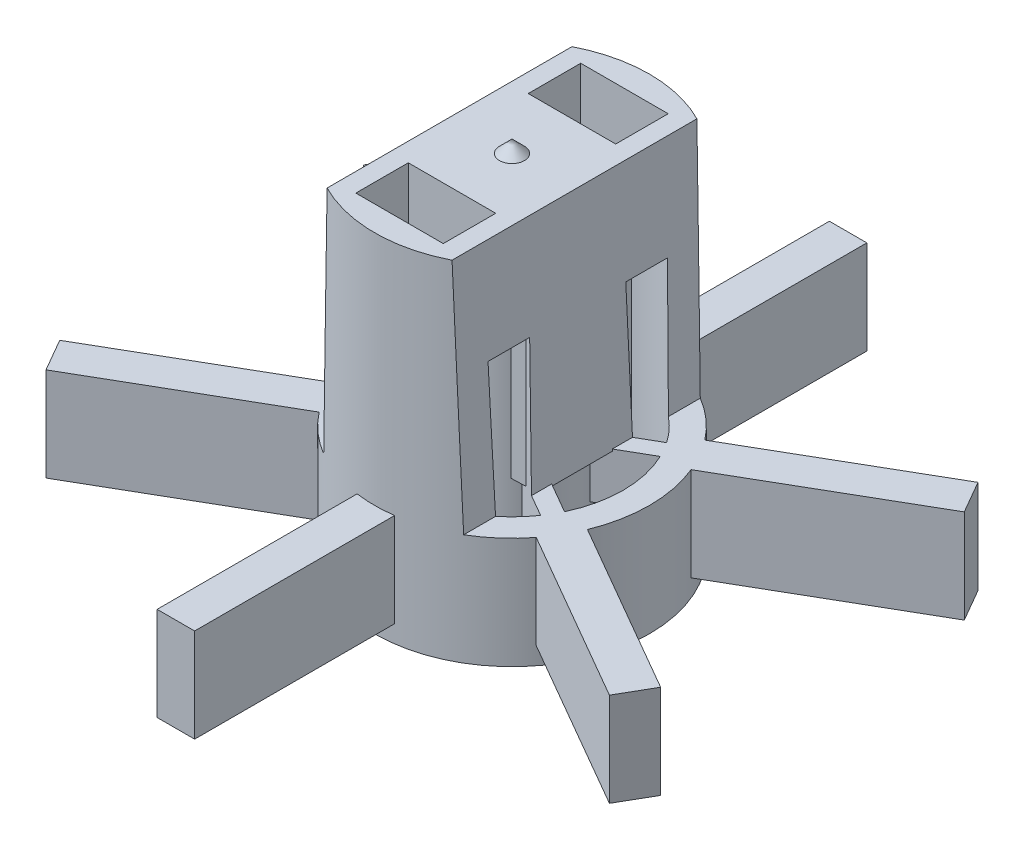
ISO-10303-21;
HEADER;
FILE_DESCRIPTION(('STEP AP214'),'2;1');
FILE_NAME('part.step','',(''),(''),'','','');
FILE_SCHEMA(('AUTOMOTIVE_DESIGN { 1 0 10303 214 1 1 1 1 }'));
ENDSEC;
DATA;
#1=APPLICATION_CONTEXT('core data for automotive mechanical design processes');
#2=APPLICATION_PROTOCOL_DEFINITION('international standard','automotive_design',2000,#1);
#3=PRODUCT_CONTEXT('',#1,'mechanical');
#4=PRODUCT('Part','Part','',(#3));
#5=PRODUCT_RELATED_PRODUCT_CATEGORY('part','',(#4));
#6=PRODUCT_DEFINITION_FORMATION('','',#4);
#7=PRODUCT_DEFINITION_CONTEXT('part definition',#1,'design');
#8=PRODUCT_DEFINITION('design','',#6,#7);
#9=PRODUCT_DEFINITION_SHAPE('','',#8);
#10=(LENGTH_UNIT() NAMED_UNIT(*) SI_UNIT(.MILLI.,.METRE.));
#11=(NAMED_UNIT(*) PLANE_ANGLE_UNIT() SI_UNIT($,.RADIAN.));
#12=(NAMED_UNIT(*) SI_UNIT($,.STERADIAN.) SOLID_ANGLE_UNIT());
#13=UNCERTAINTY_MEASURE_WITH_UNIT(LENGTH_MEASURE(1.E-05),#10,'distance_accuracy_value','');
#14=(GEOMETRIC_REPRESENTATION_CONTEXT(3) GLOBAL_UNCERTAINTY_ASSIGNED_CONTEXT((#13)) GLOBAL_UNIT_ASSIGNED_CONTEXT((#10,
#11,#12)) REPRESENTATION_CONTEXT('',''));
#15=CARTESIAN_POINT('',(0.,0.,0.));
#16=DIRECTION('',(0.,0.,1.));
#17=DIRECTION('',(1.,0.,0.));
#18=AXIS2_PLACEMENT_3D('',#15,#16,#17);
#19=CARTESIAN_POINT('',(0.,0.,0.));
#20=DIRECTION('',(0.,-1.,0.));
#21=DIRECTION('',(0.,0.,-1.));
#22=AXIS2_PLACEMENT_3D('',#19,#20,#21);
#23=CYLINDRICAL_SURFACE('',#22,5.5);
#24=DIRECTION('',(0.,-1.,0.));
#25=VECTOR('',#24,1.);
#26=CARTESIAN_POINT('',(-0.750000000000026,0.,-5.44862367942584));
#27=LINE('',#26,#25);
#28=CARTESIAN_POINT('',(-0.750000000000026,3.2,-5.44862367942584));
#29=VERTEX_POINT('',#28);
#30=CARTESIAN_POINT('',(-0.750000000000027,6.95,-5.44862367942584));
#31=VERTEX_POINT('',#30);
#32=EDGE_CURVE('E1123',#29,#31,#27,.F.);
#33=ORIENTED_EDGE('',*,*,#32,.F.);
#34=CARTESIAN_POINT('',(0.,3.2,0.));
#35=DIRECTION('',(0.,1.,0.));
#36=DIRECTION('',(-1.,0.,0.));
#37=AXIS2_PLACEMENT_3D('',#34,#35,#36);
#38=CIRCLE('',#37,5.5);
#39=CARTESIAN_POINT('',(0.749999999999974,3.2,-5.44862367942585));
#40=VERTEX_POINT('',#39);
#41=EDGE_CURVE('E1129',#29,#40,#38,.F.);
#42=ORIENTED_EDGE('',*,*,#41,.T.);
#43=DIRECTION('',(0.,-1.,0.));
#44=VECTOR('',#43,1.);
#45=CARTESIAN_POINT('',(0.749999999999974,0.,-5.44862367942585));
#46=LINE('',#45,#44);
#47=CARTESIAN_POINT('',(0.749999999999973,6.95,-5.44862367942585));
#48=VERTEX_POINT('',#47);
#49=EDGE_CURVE('E1126',#48,#40,#46,.T.);
#50=ORIENTED_EDGE('',*,*,#49,.F.);
#51=CARTESIAN_POINT('',(0.,6.95,0.));
#52=DIRECTION('',(0.,1.,0.));
#53=DIRECTION('',(-1.,0.,0.));
#54=AXIS2_PLACEMENT_3D('',#51,#52,#53);
#55=CIRCLE('',#54,5.5);
#56=EDGE_CURVE('E1120',#31,#48,#55,.F.);
#57=ORIENTED_EDGE('',*,*,#56,.F.);
#58=EDGE_LOOP('',(#33,#42,#50,#57));
#59=FACE_BOUND('',#58,.T.);
#60=CARTESIAN_POINT('',(0.,2.5,0.));
#61=DIRECTION('',(0.,-1.,0.));
#62=DIRECTION('',(0.,0.,-1.));
#63=AXIS2_PLACEMENT_3D('',#60,#61,#62);
#64=CIRCLE('',#63,5.5);
#65=CARTESIAN_POINT('',(0.,2.5,-5.5));
#66=VERTEX_POINT('',#65);
#67=EDGE_CURVE('E1037',#66,#66,#64,.T.);
#68=ORIENTED_EDGE('',*,*,#67,.F.);
#69=EDGE_LOOP('',(#68));
#70=FACE_BOUND('',#69,.T.);
#71=DIRECTION('',(0.,-1.,0.));
#72=VECTOR('',#71,1.);
#73=CARTESIAN_POINT('',(-5.0936465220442,0.,2.07479278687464));
#74=LINE('',#73,#72);
#75=CARTESIAN_POINT('',(-5.0936465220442,6.95,2.07479278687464));
#76=VERTEX_POINT('',#75);
#77=CARTESIAN_POINT('',(-5.0936465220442,3.2,2.07479278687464));
#78=VERTEX_POINT('',#77);
#79=EDGE_CURVE('E586',#76,#78,#74,.T.);
#80=ORIENTED_EDGE('',*,*,#79,.F.);
#81=CARTESIAN_POINT('',(0.,6.95,0.));
#82=DIRECTION('',(0.,-1.,0.));
#83=DIRECTION('',(1.,0.,0.));
#84=AXIS2_PLACEMENT_3D('',#81,#82,#83);
#85=CIRCLE('',#84,5.5);
#86=CARTESIAN_POINT('',(-5.09364652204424,6.95,-2.07479278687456));
#87=VERTEX_POINT('',#86);
#88=EDGE_CURVE('E861',#87,#76,#85,.F.);
#89=ORIENTED_EDGE('',*,*,#88,.F.);
#90=DIRECTION('',(0.,-1.,0.));
#91=VECTOR('',#90,1.);
#92=CARTESIAN_POINT('',(-5.09364652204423,0.,-2.07479278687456));
#93=LINE('',#92,#91);
#94=CARTESIAN_POINT('',(-5.09364652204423,3.2,-2.07479278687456));
#95=VERTEX_POINT('',#94);
#96=EDGE_CURVE('E607',#95,#87,#93,.F.);
#97=ORIENTED_EDGE('',*,*,#96,.F.);
#98=CARTESIAN_POINT('',(0.,3.2,0.));
#99=DIRECTION('',(0.,1.,0.));
#100=DIRECTION('',(-1.,0.,0.));
#101=AXIS2_PLACEMENT_3D('',#98,#99,#100);
#102=CIRCLE('',#101,5.5);
#103=CARTESIAN_POINT('',(-4.34364652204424,3.2,-3.37383089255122));
#104=VERTEX_POINT('',#103);
#105=EDGE_CURVE('E1131',#95,#104,#102,.F.);
#106=ORIENTED_EDGE('',*,*,#105,.T.);
#107=DIRECTION('',(0.,-1.,0.));
#108=VECTOR('',#107,1.);
#109=CARTESIAN_POINT('',(-4.34364652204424,0.,-3.37383089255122));
#110=LINE('',#109,#108);
#111=CARTESIAN_POINT('',(-4.34364652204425,6.95,-3.37383089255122));
#112=VERTEX_POINT('',#111);
#113=EDGE_CURVE('E611',#112,#104,#110,.T.);
#114=ORIENTED_EDGE('',*,*,#113,.F.);
#115=CARTESIAN_POINT('',(-2.8,6.95,-4.73392015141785));
#116=VERTEX_POINT('',#115);
#117=EDGE_CURVE('E857',#116,#112,#85,.F.);
#118=ORIENTED_EDGE('',*,*,#117,.F.);
#119=CARTESIAN_POINT('',(0.,95.1500000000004,0.));
#120=DIRECTION('',(0.999496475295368,-0.0317300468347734,0.));
#121=DIRECTION('',(-0.0317300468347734,-0.999496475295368,0.));
#122=AXIS2_PLACEMENT_3D('',#119,#120,#121);
#123=ELLIPSE('',#122,173.337279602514,5.5);
#124=CARTESIAN_POINT('',(-2.5,16.4,-4.89897948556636));
#125=VERTEX_POINT('',#124);
#126=EDGE_CURVE('E875',#125,#116,#123,.F.);
#127=ORIENTED_EDGE('',*,*,#126,.F.);
#128=CARTESIAN_POINT('',(0.,16.4,0.));
#129=DIRECTION('',(0.,-1.,0.));
#130=DIRECTION('',(0.,0.,-1.));
#131=AXIS2_PLACEMENT_3D('',#128,#129,#130);
#132=CIRCLE('',#131,5.5);
#133=CARTESIAN_POINT('',(2.5,16.4,-4.89897948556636));
#134=VERTEX_POINT('',#133);
#135=EDGE_CURVE('E1040',#125,#134,#132,.T.);
#136=ORIENTED_EDGE('',*,*,#135,.T.);
#137=CARTESIAN_POINT('',(0.,95.1499999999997,0.));
#138=DIRECTION('',(-0.999496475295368,-0.0317300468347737,0.));
#139=DIRECTION('',(0.0317300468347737,-0.999496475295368,0.));
#140=AXIS2_PLACEMENT_3D('',#137,#138,#139);
#141=ELLIPSE('',#140,173.337279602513,5.5);
#142=CARTESIAN_POINT('',(2.8,6.95,-4.73392015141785));
#143=VERTEX_POINT('',#142);
#144=EDGE_CURVE('E901',#143,#134,#141,.F.);
#145=ORIENTED_EDGE('',*,*,#144,.F.);
#146=CARTESIAN_POINT('',(0.,6.95,0.));
#147=DIRECTION('',(0.,-1.,0.));
#148=DIRECTION('',(1.,0.,0.));
#149=AXIS2_PLACEMENT_3D('',#146,#147,#148);
#150=CIRCLE('',#149,5.5);
#151=CARTESIAN_POINT('',(4.34364652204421,6.95,-3.37383089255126));
#152=VERTEX_POINT('',#151);
#153=EDGE_CURVE('E920',#152,#143,#150,.F.);
#154=ORIENTED_EDGE('',*,*,#153,.F.);
#155=DIRECTION('',(0.,-1.,0.));
#156=VECTOR('',#155,1.);
#157=CARTESIAN_POINT('',(4.34364652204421,0.,-3.37383089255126));
#158=LINE('',#157,#156);
#159=CARTESIAN_POINT('',(4.34364652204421,3.2,-3.37383089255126));
#160=VERTEX_POINT('',#159);
#161=EDGE_CURVE('E653',#160,#152,#158,.F.);
#162=ORIENTED_EDGE('',*,*,#161,.F.);
#163=CARTESIAN_POINT('',(0.,3.2,0.));
#164=DIRECTION('',(0.,1.,0.));
#165=DIRECTION('',(0.,0.,1.));
#166=AXIS2_PLACEMENT_3D('',#163,#164,#165);
#167=CIRCLE('',#166,5.5);
#168=CARTESIAN_POINT('',(5.09364652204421,3.2,-2.0747927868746));
#169=VERTEX_POINT('',#168);
#170=EDGE_CURVE('E1117',#160,#169,#167,.F.);
#171=ORIENTED_EDGE('',*,*,#170,.T.);
#172=DIRECTION('',(0.,-1.,0.));
#173=VECTOR('',#172,1.);
#174=CARTESIAN_POINT('',(5.09364652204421,0.,-2.07479278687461));
#175=LINE('',#174,#173);
#176=CARTESIAN_POINT('',(5.09364652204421,6.95,-2.07479278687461));
#177=VERTEX_POINT('',#176);
#178=EDGE_CURVE('E657',#177,#169,#175,.T.);
#179=ORIENTED_EDGE('',*,*,#178,.F.);
#180=CARTESIAN_POINT('',(5.09364652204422,6.95,2.07479278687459));
#181=VERTEX_POINT('',#180);
#182=EDGE_CURVE('E919',#181,#177,#150,.F.);
#183=ORIENTED_EDGE('',*,*,#182,.F.);
#184=DIRECTION('',(0.,-1.,0.));
#185=VECTOR('',#184,1.);
#186=CARTESIAN_POINT('',(5.09364652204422,0.,2.07479278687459));
#187=LINE('',#186,#185);
#188=CARTESIAN_POINT('',(5.09364652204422,3.2,2.07479278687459));
#189=VERTEX_POINT('',#188);
#190=EDGE_CURVE('E678',#189,#181,#187,.F.);
#191=ORIENTED_EDGE('',*,*,#190,.F.);
#192=CARTESIAN_POINT('',(0.,3.2,0.));
#193=DIRECTION('',(0.,1.,0.));
#194=DIRECTION('',(-1.,0.,0.));
#195=AXIS2_PLACEMENT_3D('',#192,#193,#194);
#196=CIRCLE('',#195,5.5);
#197=CARTESIAN_POINT('',(4.34364652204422,3.2,3.37383089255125));
#198=VERTEX_POINT('',#197);
#199=EDGE_CURVE('E1114',#189,#198,#196,.F.);
#200=ORIENTED_EDGE('',*,*,#199,.T.);
#201=DIRECTION('',(0.,-1.,0.));
#202=VECTOR('',#201,1.);
#203=CARTESIAN_POINT('',(4.34364652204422,0.,3.37383089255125));
#204=LINE('',#203,#202);
#205=CARTESIAN_POINT('',(4.34364652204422,6.95,3.37383089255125));
#206=VERTEX_POINT('',#205);
#207=EDGE_CURVE('E682',#206,#198,#204,.T.);
#208=ORIENTED_EDGE('',*,*,#207,.F.);
#209=CARTESIAN_POINT('',(2.8,6.95,4.73392015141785));
#210=VERTEX_POINT('',#209);
#211=EDGE_CURVE('E915',#210,#206,#150,.F.);
#212=ORIENTED_EDGE('',*,*,#211,.F.);
#213=CARTESIAN_POINT('',(2.5,16.4,4.89897948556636));
#214=VERTEX_POINT('',#213);
#215=EDGE_CURVE('E899',#214,#210,#141,.F.);
#216=ORIENTED_EDGE('',*,*,#215,.F.);
#217=CARTESIAN_POINT('',(-2.5,16.4,4.89897948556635));
#218=VERTEX_POINT('',#217);
#219=EDGE_CURVE('E1041',#214,#218,#132,.T.);
#220=ORIENTED_EDGE('',*,*,#219,.T.);
#221=CARTESIAN_POINT('',(-2.8,6.95,4.73392015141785));
#222=VERTEX_POINT('',#221);
#223=EDGE_CURVE('E878',#222,#218,#123,.F.);
#224=ORIENTED_EDGE('',*,*,#223,.F.);
#225=CARTESIAN_POINT('',(-4.34364652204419,6.95,3.37383089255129));
#226=VERTEX_POINT('',#225);
#227=EDGE_CURVE('E862',#226,#222,#85,.F.);
#228=ORIENTED_EDGE('',*,*,#227,.F.);
#229=DIRECTION('',(0.,-1.,0.));
#230=VECTOR('',#229,1.);
#231=CARTESIAN_POINT('',(-4.34364652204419,0.,3.37383089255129));
#232=LINE('',#231,#230);
#233=CARTESIAN_POINT('',(-4.34364652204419,3.2,3.37383089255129));
#234=VERTEX_POINT('',#233);
#235=EDGE_CURVE('E582',#234,#226,#232,.F.);
#236=ORIENTED_EDGE('',*,*,#235,.F.);
#237=CARTESIAN_POINT('',(0.,3.2,0.));
#238=DIRECTION('',(0.,1.,0.));
#239=DIRECTION('',(0.,0.,1.));
#240=AXIS2_PLACEMENT_3D('',#237,#238,#239);
#241=CIRCLE('',#240,5.5);
#242=EDGE_CURVE('E1134',#234,#78,#241,.F.);
#243=ORIENTED_EDGE('',*,*,#242,.T.);
#244=EDGE_LOOP('',(#80,#89,#97,#106,#114,#118,#127,#136,#145,#154,#162,#171,#179,#183,#191,#200,
#208,#212,#216,#220,#224,#228,#236,#243));
#245=FACE_BOUND('',#244,.T.);
#246=DIRECTION('',(0.,-1.,0.));
#247=VECTOR('',#246,1.);
#248=CARTESIAN_POINT('',(0.750000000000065,0.,5.44862367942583));
#249=LINE('',#248,#247);
#250=CARTESIAN_POINT('',(0.750000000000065,3.2,5.44862367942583));
#251=VERTEX_POINT('',#250);
#252=CARTESIAN_POINT('',(0.750000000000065,6.95,5.44862367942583));
#253=VERTEX_POINT('',#252);
#254=EDGE_CURVE('E51',#251,#253,#249,.F.);
#255=ORIENTED_EDGE('',*,*,#254,.F.);
#256=CARTESIAN_POINT('',(0.,3.2,0.));
#257=DIRECTION('',(0.,1.,0.));
#258=DIRECTION('',(-1.,0.,0.));
#259=AXIS2_PLACEMENT_3D('',#256,#257,#258);
#260=CIRCLE('',#259,5.5);
#261=CARTESIAN_POINT('',(-0.749999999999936,3.2,5.44862367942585));
#262=VERTEX_POINT('',#261);
#263=EDGE_CURVE('E11',#251,#262,#260,.F.);
#264=ORIENTED_EDGE('',*,*,#263,.T.);
#265=DIRECTION('',(0.,-1.,0.));
#266=VECTOR('',#265,1.);
#267=CARTESIAN_POINT('',(-0.749999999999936,0.,5.44862367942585));
#268=LINE('',#267,#266);
#269=CARTESIAN_POINT('',(-0.749999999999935,6.95,5.44862367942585));
#270=VERTEX_POINT('',#269);
#271=EDGE_CURVE('E41',#270,#262,#268,.T.);
#272=ORIENTED_EDGE('',*,*,#271,.F.);
#273=CARTESIAN_POINT('',(0.,6.95,0.));
#274=DIRECTION('',(0.,1.,0.));
#275=DIRECTION('',(-1.,0.,0.));
#276=AXIS2_PLACEMENT_3D('',#273,#274,#275);
#277=CIRCLE('',#276,5.5);
#278=EDGE_CURVE('E1137',#253,#270,#277,.F.);
#279=ORIENTED_EDGE('',*,*,#278,.F.);
#280=EDGE_LOOP('',(#255,#264,#272,#279));
#281=FACE_BOUND('',#280,.T.);
#282=ADVANCED_FACE('F33',(#59,#70,#245,#281),#23,.T.);
#283=CARTESIAN_POINT('',(2.4,12.3,0.));
#284=DIRECTION('',(0.,-1.,0.));
#285=DIRECTION('',(0.,0.,-1.));
#286=AXIS2_PLACEMENT_3D('',#283,#284,#285);
#287=PLANE('',#286);
#288=DIRECTION('',(-0.866025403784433,0.,0.50000000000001));
#289=VECTOR('',#288,1.);
#290=CARTESIAN_POINT('',(-3.93862066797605,12.3,2.6781088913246));
#291=LINE('',#290,#289);
#292=CARTESIAN_POINT('',(-2.27108743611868,12.3,1.71535813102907));
#293=VERTEX_POINT('',#292);
#294=CARTESIAN_POINT('',(-2.63015873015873,12.3,1.92266803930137));
#295=VERTEX_POINT('',#294);
#296=EDGE_CURVE('E918',#293,#295,#291,.T.);
#297=ORIENTED_EDGE('',*,*,#296,.F.);
#298=DIRECTION('',(1.,0.,0.));
#299=VECTOR('',#298,1.);
#300=CARTESIAN_POINT('',(2.4,12.3,1.71535813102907));
#301=LINE('',#300,#299);
#302=CARTESIAN_POINT('',(-1.67855487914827,12.3,1.71535813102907));
#303=VERTEX_POINT('',#302);
#304=EDGE_CURVE('E777',#293,#303,#301,.T.);
#305=ORIENTED_EDGE('',*,*,#304,.T.);
#306=CARTESIAN_POINT('',(0.,12.3,0.));
#307=DIRECTION('',(0.,-1.,0.));
#308=DIRECTION('',(0.,0.,-1.));
#309=AXIS2_PLACEMENT_3D('',#306,#307,#308);
#310=CIRCLE('',#309,2.4);
#311=CARTESIAN_POINT('',(-0.35,12.3,2.37434201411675));
#312=VERTEX_POINT('',#311);
#313=EDGE_CURVE('E1023',#312,#303,#310,.T.);
#314=ORIENTED_EDGE('',*,*,#313,.F.);
#315=DIRECTION('',(0.,0.,-1.));
#316=VECTOR('',#315,1.);
#317=CARTESIAN_POINT('',(-0.350000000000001,12.3,4.75));
#318=LINE('',#317,#316);
#319=CARTESIAN_POINT('',(-0.350000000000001,12.3,4.43621460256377));
#320=VERTEX_POINT('',#319);
#321=EDGE_CURVE('E1005',#320,#312,#318,.T.);
#322=ORIENTED_EDGE('',*,*,#321,.F.);
#323=CARTESIAN_POINT('',(0.,12.3,0.));
#324=DIRECTION('',(0.,-1.,0.));
#325=DIRECTION('',(0.,0.,-1.));
#326=AXIS2_PLACEMENT_3D('',#323,#324,#325);
#327=CIRCLE('',#326,4.45);
#328=CARTESIAN_POINT('',(-2.63015873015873,12.3,3.58953549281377));
#329=VERTEX_POINT('',#328);
#330=EDGE_CURVE('E1029',#320,#329,#327,.T.);
#331=ORIENTED_EDGE('',*,*,#330,.T.);
#332=DIRECTION('',(0.,0.,1.));
#333=VECTOR('',#332,1.);
#334=CARTESIAN_POINT('',(-2.63015873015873,12.3,0.));
#335=LINE('',#334,#333);
#336=EDGE_CURVE('E865',#295,#329,#335,.T.);
#337=ORIENTED_EDGE('',*,*,#336,.F.);
#338=EDGE_LOOP('',(#297,#305,#314,#322,#331,#337));
#339=FACE_BOUND('',#338,.T.);
#340=ADVANCED_FACE('F1153',(#339),#287,.T.);
#341=CARTESIAN_POINT('',(0.,0.,0.));
#342=DIRECTION('',(0.,-1.,0.));
#343=DIRECTION('',(0.,0.,-1.));
#344=AXIS2_PLACEMENT_3D('',#341,#342,#343);
#345=CYLINDRICAL_SURFACE('',#344,2.4);
#346=CARTESIAN_POINT('',(0.,2.5,0.));
#347=DIRECTION('',(0.,-1.,0.));
#348=DIRECTION('',(0.,0.,-1.));
#349=AXIS2_PLACEMENT_3D('',#346,#347,#348);
#350=CIRCLE('',#349,2.4);
#351=CARTESIAN_POINT('',(0.,2.5,-2.4));
#352=VERTEX_POINT('',#351);
#353=EDGE_CURVE('E1019',#352,#352,#350,.T.);
#354=ORIENTED_EDGE('',*,*,#353,.F.);
#355=EDGE_LOOP('',(#354));
#356=FACE_BOUND('',#355,.T.);
#357=DIRECTION('',(0.,-1.,0.));
#358=VECTOR('',#357,1.);
#359=CARTESIAN_POINT('',(-2.23124050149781,0.,0.884062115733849));
#360=LINE('',#359,#358);
#361=CARTESIAN_POINT('',(-2.23124050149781,5.,0.884062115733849));
#362=VERTEX_POINT('',#361);
#363=CARTESIAN_POINT('',(-2.23124050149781,6.8549389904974,0.884062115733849));
#364=VERTEX_POINT('',#363);
#365=EDGE_CURVE('E1098',#362,#364,#360,.F.);
#366=ORIENTED_EDGE('',*,*,#365,.T.);
#367=CARTESIAN_POINT('',(0.,6.78410595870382,0.));
#368=DIRECTION('',(0.0317300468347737,0.999496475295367,0.));
#369=DIRECTION('',(0.999496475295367,-0.0317300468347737,0.));
#370=AXIS2_PLACEMENT_3D('',#367,#368,#369);
#371=ELLIPSE('',#370,2.40120906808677,2.4);
#372=CARTESIAN_POINT('',(-2.23124050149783,6.8549389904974,-0.884062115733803));
#373=VERTEX_POINT('',#372);
#374=EDGE_CURVE('E768',#373,#364,#371,.T.);
#375=ORIENTED_EDGE('',*,*,#374,.F.);
#376=DIRECTION('',(0.,-1.,0.));
#377=VECTOR('',#376,1.);
#378=CARTESIAN_POINT('',(-2.23124050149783,0.,-0.884062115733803));
#379=LINE('',#378,#377);
#380=CARTESIAN_POINT('',(-2.23124050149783,5.,-0.884062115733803));
#381=VERTEX_POINT('',#380);
#382=EDGE_CURVE('E1093',#373,#381,#379,.T.);
#383=ORIENTED_EDGE('',*,*,#382,.T.);
#384=CARTESIAN_POINT('',(0.,5.,0.));
#385=DIRECTION('',(0.,1.,0.));
#386=DIRECTION('',(0.,0.,1.));
#387=AXIS2_PLACEMENT_3D('',#384,#385,#386);
#388=CIRCLE('',#387,2.4);
#389=CARTESIAN_POINT('',(-1.88124050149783,5.,-1.49027989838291));
#390=VERTEX_POINT('',#389);
#391=EDGE_CURVE('E1087',#381,#390,#388,.F.);
#392=ORIENTED_EDGE('',*,*,#391,.T.);
#393=DIRECTION('',(0.,-1.,0.));
#394=VECTOR('',#393,1.);
#395=CARTESIAN_POINT('',(-1.88124050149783,0.,-1.49027989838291));
#396=LINE('',#395,#394);
#397=CARTESIAN_POINT('',(-1.88124050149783,6.84382787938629,-1.49027989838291));
#398=VERTEX_POINT('',#397);
#399=EDGE_CURVE('E1090',#390,#398,#396,.F.);
#400=ORIENTED_EDGE('',*,*,#399,.T.);
#401=CARTESIAN_POINT('',(-1.71601408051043,6.83858259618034,-1.6778842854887));
#402=VERTEX_POINT('',#401);
#403=EDGE_CURVE('E756',#402,#398,#371,.T.);
#404=ORIENTED_EDGE('',*,*,#403,.F.);
#405=DIRECTION('',(0.,-1.,0.));
#406=VECTOR('',#405,1.);
#407=CARTESIAN_POINT('',(-1.71601408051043,0.,-1.6778842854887));
#408=LINE('',#407,#406);
#409=CARTESIAN_POINT('',(-1.71601408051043,12.3,-1.6778842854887));
#410=VERTEX_POINT('',#409);
#411=EDGE_CURVE('E752',#410,#402,#408,.T.);
#412=ORIENTED_EDGE('',*,*,#411,.F.);
#413=CARTESIAN_POINT('',(-0.350000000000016,12.3,-2.37434201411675));
#414=VERTEX_POINT('',#413);
#415=EDGE_CURVE('E1027',#410,#414,#310,.T.);
#416=ORIENTED_EDGE('',*,*,#415,.T.);
#417=DIRECTION('',(0.,-1.,0.));
#418=VECTOR('',#417,1.);
#419=CARTESIAN_POINT('',(-0.350000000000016,0.,-2.37434201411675));
#420=LINE('',#419,#418);
#421=CARTESIAN_POINT('',(-0.350000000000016,5.,-2.37434201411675));
#422=VERTEX_POINT('',#421);
#423=EDGE_CURVE('E1084',#414,#422,#420,.T.);
#424=ORIENTED_EDGE('',*,*,#423,.T.);
#425=CARTESIAN_POINT('',(0.,5.,0.));
#426=DIRECTION('',(0.,1.,0.));
#427=DIRECTION('',(0.,0.,1.));
#428=AXIS2_PLACEMENT_3D('',#425,#426,#427);
#429=CIRCLE('',#428,2.4);
#430=CARTESIAN_POINT('',(0.349999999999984,5.,-2.37434201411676));
#431=VERTEX_POINT('',#430);
#432=EDGE_CURVE('E1078',#422,#431,#429,.F.);
#433=ORIENTED_EDGE('',*,*,#432,.T.);
#434=DIRECTION('',(0.,-1.,0.));
#435=VECTOR('',#434,1.);
#436=CARTESIAN_POINT('',(0.349999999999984,0.,-2.37434201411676));
#437=LINE('',#436,#435);
#438=CARTESIAN_POINT('',(0.349999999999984,12.3,-2.37434201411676));
#439=VERTEX_POINT('',#438);
#440=EDGE_CURVE('E1081',#431,#439,#437,.F.);
#441=ORIENTED_EDGE('',*,*,#440,.T.);
#442=CARTESIAN_POINT('',(1.71601408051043,12.3,-1.6778842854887));
#443=VERTEX_POINT('',#442);
#444=EDGE_CURVE('E1028',#439,#443,#310,.T.);
#445=ORIENTED_EDGE('',*,*,#444,.T.);
#446=DIRECTION('',(0.,-1.,0.));
#447=VECTOR('',#446,1.);
#448=CARTESIAN_POINT('',(1.71601408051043,0.,-1.6778842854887));
#449=LINE('',#448,#447);
#450=CARTESIAN_POINT('',(1.71601408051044,6.83858259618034,-1.6778842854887));
#451=VERTEX_POINT('',#450);
#452=EDGE_CURVE('E808',#443,#451,#449,.T.);
#453=ORIENTED_EDGE('',*,*,#452,.T.);
#454=CARTESIAN_POINT('',(0.,6.78410595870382,0.));
#455=DIRECTION('',(0.0317300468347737,-0.999496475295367,0.));
#456=DIRECTION('',(-0.999496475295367,-0.0317300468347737,0.));
#457=AXIS2_PLACEMENT_3D('',#454,#455,#456);
#458=ELLIPSE('',#457,2.40120906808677,2.4);
#459=CARTESIAN_POINT('',(1.88124050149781,6.84382787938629,-1.49027989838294));
#460=VERTEX_POINT('',#459);
#461=EDGE_CURVE('E802',#451,#460,#458,.T.);
#462=ORIENTED_EDGE('',*,*,#461,.T.);
#463=DIRECTION('',(0.,-1.,0.));
#464=VECTOR('',#463,1.);
#465=CARTESIAN_POINT('',(1.88124050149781,0.,-1.49027989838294));
#466=LINE('',#465,#464);
#467=CARTESIAN_POINT('',(1.88124050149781,5.,-1.49027989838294));
#468=VERTEX_POINT('',#467);
#469=EDGE_CURVE('E1076',#460,#468,#466,.T.);
#470=ORIENTED_EDGE('',*,*,#469,.T.);
#471=CARTESIAN_POINT('',(0.,5.,0.));
#472=DIRECTION('',(0.,1.,0.));
#473=DIRECTION('',(0.,0.,1.));
#474=AXIS2_PLACEMENT_3D('',#471,#472,#473);
#475=CIRCLE('',#474,2.4);
#476=CARTESIAN_POINT('',(2.23124050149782,5.,-0.884062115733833));
#477=VERTEX_POINT('',#476);
#478=EDGE_CURVE('E1070',#468,#477,#475,.F.);
#479=ORIENTED_EDGE('',*,*,#478,.T.);
#480=DIRECTION('',(0.,-1.,0.));
#481=VECTOR('',#480,1.);
#482=CARTESIAN_POINT('',(2.23124050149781,0.,-0.884062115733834));
#483=LINE('',#482,#481);
#484=CARTESIAN_POINT('',(2.23124050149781,6.8549389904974,-0.884062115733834));
#485=VERTEX_POINT('',#484);
#486=EDGE_CURVE('E1073',#477,#485,#483,.F.);
#487=ORIENTED_EDGE('',*,*,#486,.T.);
#488=CARTESIAN_POINT('',(2.23124050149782,6.8549389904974,0.884062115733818));
#489=VERTEX_POINT('',#488);
#490=EDGE_CURVE('E806',#485,#489,#458,.T.);
#491=ORIENTED_EDGE('',*,*,#490,.T.);
#492=DIRECTION('',(0.,-1.,0.));
#493=VECTOR('',#492,1.);
#494=CARTESIAN_POINT('',(2.23124050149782,0.,0.884062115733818));
#495=LINE('',#494,#493);
#496=CARTESIAN_POINT('',(2.23124050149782,5.,0.884062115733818));
#497=VERTEX_POINT('',#496);
#498=EDGE_CURVE('E1068',#489,#497,#495,.T.);
#499=ORIENTED_EDGE('',*,*,#498,.T.);
#500=CARTESIAN_POINT('',(0.,5.,0.));
#501=DIRECTION('',(0.,1.,0.));
#502=DIRECTION('',(0.,0.,1.));
#503=AXIS2_PLACEMENT_3D('',#500,#501,#502);
#504=CIRCLE('',#503,2.4);
#505=CARTESIAN_POINT('',(1.88124050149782,5.,1.49027989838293));
#506=VERTEX_POINT('',#505);
#507=EDGE_CURVE('E1062',#497,#506,#504,.F.);
#508=ORIENTED_EDGE('',*,*,#507,.T.);
#509=DIRECTION('',(0.,-1.,0.));
#510=VECTOR('',#509,1.);
#511=CARTESIAN_POINT('',(1.88124050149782,0.,1.49027989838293));
#512=LINE('',#511,#510);
#513=CARTESIAN_POINT('',(1.88124050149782,6.84382787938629,1.49027989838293));
#514=VERTEX_POINT('',#513);
#515=EDGE_CURVE('E1065',#506,#514,#512,.F.);
#516=ORIENTED_EDGE('',*,*,#515,.T.);
#517=CARTESIAN_POINT('',(1.67855487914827,6.83739341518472,1.71535813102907));
#518=VERTEX_POINT('',#517);
#519=EDGE_CURVE('E807',#514,#518,#458,.T.);
#520=ORIENTED_EDGE('',*,*,#519,.T.);
#521=DIRECTION('',(0.,-1.,0.));
#522=VECTOR('',#521,1.);
#523=CARTESIAN_POINT('',(1.67855487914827,0.,1.71535813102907));
#524=LINE('',#523,#522);
#525=CARTESIAN_POINT('',(1.67855487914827,12.3,1.71535813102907));
#526=VERTEX_POINT('',#525);
#527=EDGE_CURVE('E798',#518,#526,#524,.F.);
#528=ORIENTED_EDGE('',*,*,#527,.T.);
#529=CARTESIAN_POINT('',(0.35,12.3,2.37434201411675));
#530=VERTEX_POINT('',#529);
#531=EDGE_CURVE('E1022',#526,#530,#310,.T.);
#532=ORIENTED_EDGE('',*,*,#531,.T.);
#533=DIRECTION('',(0.,-1.,0.));
#534=VECTOR('',#533,1.);
#535=CARTESIAN_POINT('',(0.35,0.,2.37434201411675));
#536=LINE('',#535,#534);
#537=CARTESIAN_POINT('',(0.35,5.,2.37434201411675));
#538=VERTEX_POINT('',#537);
#539=EDGE_CURVE('E1059',#530,#538,#536,.T.);
#540=ORIENTED_EDGE('',*,*,#539,.T.);
#541=CARTESIAN_POINT('',(0.,5.,0.));
#542=DIRECTION('',(0.,1.,0.));
#543=DIRECTION('',(0.,0.,1.));
#544=AXIS2_PLACEMENT_3D('',#541,#542,#543);
#545=CIRCLE('',#544,2.4);
#546=CARTESIAN_POINT('',(-0.35,5.,2.37434201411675));
#547=VERTEX_POINT('',#546);
#548=EDGE_CURVE('E1053',#538,#547,#545,.F.);
#549=ORIENTED_EDGE('',*,*,#548,.T.);
#550=DIRECTION('',(0.,-1.,0.));
#551=VECTOR('',#550,1.);
#552=CARTESIAN_POINT('',(-0.35,0.,2.37434201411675));
#553=LINE('',#552,#551);
#554=EDGE_CURVE('E1056',#547,#312,#553,.F.);
#555=ORIENTED_EDGE('',*,*,#554,.T.);
#556=ORIENTED_EDGE('',*,*,#313,.T.);
#557=DIRECTION('',(0.,-1.,0.));
#558=VECTOR('',#557,1.);
#559=CARTESIAN_POINT('',(-1.67855487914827,0.,1.71535813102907));
#560=LINE('',#559,#558);
#561=CARTESIAN_POINT('',(-1.67855487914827,6.83739341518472,1.71535813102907));
#562=VERTEX_POINT('',#561);
#563=EDGE_CURVE('E760',#562,#303,#560,.F.);
#564=ORIENTED_EDGE('',*,*,#563,.F.);
#565=CARTESIAN_POINT('',(-1.8812405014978,6.84382787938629,1.49027989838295));
#566=VERTEX_POINT('',#565);
#567=EDGE_CURVE('E742',#566,#562,#371,.T.);
#568=ORIENTED_EDGE('',*,*,#567,.F.);
#569=DIRECTION('',(0.,-1.,0.));
#570=VECTOR('',#569,1.);
#571=CARTESIAN_POINT('',(-1.8812405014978,0.,1.49027989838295));
#572=LINE('',#571,#570);
#573=CARTESIAN_POINT('',(-1.8812405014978,5.,1.49027989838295));
#574=VERTEX_POINT('',#573);
#575=EDGE_CURVE('E1101',#566,#574,#572,.T.);
#576=ORIENTED_EDGE('',*,*,#575,.T.);
#577=CARTESIAN_POINT('',(0.,5.,0.));
#578=DIRECTION('',(0.,1.,0.));
#579=DIRECTION('',(0.,0.,1.));
#580=AXIS2_PLACEMENT_3D('',#577,#578,#579);
#581=CIRCLE('',#580,2.4);
#582=EDGE_CURVE('E1095',#574,#362,#581,.F.);
#583=ORIENTED_EDGE('',*,*,#582,.T.);
#584=EDGE_LOOP('',(#366,#375,#383,#392,#400,#404,#412,#416,#424,#433,#441,#445,#453,#462,#470,
#479,#487,#491,#499,#508,#516,#520,#528,#532,#540,#549,#555,#556,#564,#568,#576,#583));
#585=FACE_BOUND('',#584,.T.);
#586=ADVANCED_FACE('F1159',(#356,#585),#345,.T.);
#587=ORIENTED_EDGE('',*,*,#415,.F.);
#588=DIRECTION('',(-1.,0.,0.));
#589=VECTOR('',#588,1.);
#590=CARTESIAN_POINT('',(2.4,12.3,-1.6778842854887));
#591=LINE('',#590,#589);
#592=CARTESIAN_POINT('',(-2.20618083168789,12.3,-1.6778842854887));
#593=VERTEX_POINT('',#592);
#594=EDGE_CURVE('E782',#410,#593,#591,.T.);
#595=ORIENTED_EDGE('',*,*,#594,.T.);
#596=DIRECTION('',(0.866025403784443,0.,0.499999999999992));
#597=VECTOR('',#596,1.);
#598=CARTESIAN_POINT('',(-3.93862066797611,12.3,-2.67810889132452));
#599=LINE('',#598,#597);
#600=CARTESIAN_POINT('',(-2.63015873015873,12.3,-1.92266803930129));
#601=VERTEX_POINT('',#600);
#602=EDGE_CURVE('E935',#601,#593,#599,.T.);
#603=ORIENTED_EDGE('',*,*,#602,.F.);
#604=DIRECTION('',(0.,0.,1.));
#605=VECTOR('',#604,1.);
#606=CARTESIAN_POINT('',(-2.63015873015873,12.3,0.));
#607=LINE('',#606,#605);
#608=CARTESIAN_POINT('',(-2.63015873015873,12.3,-3.58953549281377));
#609=VERTEX_POINT('',#608);
#610=EDGE_CURVE('E873',#609,#601,#607,.T.);
#611=ORIENTED_EDGE('',*,*,#610,.F.);
#612=CARTESIAN_POINT('',(-0.35000000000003,12.3,-4.43621460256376));
#613=VERTEX_POINT('',#612);
#614=EDGE_CURVE('E1033',#609,#613,#327,.T.);
#615=ORIENTED_EDGE('',*,*,#614,.T.);
#616=DIRECTION('',(0.,0.,-1.));
#617=VECTOR('',#616,1.);
#618=CARTESIAN_POINT('',(-0.350000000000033,12.3,-4.75));
#619=LINE('',#618,#617);
#620=EDGE_CURVE('E950',#414,#613,#619,.T.);
#621=ORIENTED_EDGE('',*,*,#620,.F.);
#622=EDGE_LOOP('',(#587,#595,#603,#611,#615,#621));
#623=FACE_BOUND('',#622,.T.);
#624=ADVANCED_FACE('F1162',(#623),#287,.T.);
#625=CARTESIAN_POINT('',(-4.2886206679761,5.,-2.07189110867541));
#626=DIRECTION('',(0.499999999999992,0.,-0.866025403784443));
#627=DIRECTION('',(-0.866025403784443,0.,-0.499999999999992));
#628=AXIS2_PLACEMENT_3D('',#625,#626,#627);
#629=PLANE('',#628);
#630=DIRECTION('',(0.865698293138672,-0.0274824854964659,0.499811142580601));
#631=VECTOR('',#630,1.);
#632=CARTESIAN_POINT('',(-4.24293489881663,6.918802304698,-2.04551441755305));
#633=LINE('',#632,#631);
#634=CARTESIAN_POINT('',(-2.80244214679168,6.87307237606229,-1.21384553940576));
#635=VERTEX_POINT('',#634);
#636=EDGE_CURVE('E791',#635,#373,#633,.T.);
#637=ORIENTED_EDGE('',*,*,#636,.F.);
#638=DIRECTION('',(-0.0317247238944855,-0.999328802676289,-0.0183162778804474));
#639=VECTOR('',#638,1.);
#640=CARTESIAN_POINT('',(-2.86381933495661,4.9396909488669,-1.24928167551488));
#641=LINE('',#640,#639);
#642=CARTESIAN_POINT('',(-2.8,6.95,-1.21243556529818));
#643=VERTEX_POINT('',#642);
#644=EDGE_CURVE('E771',#643,#635,#641,.T.);
#645=ORIENTED_EDGE('',*,*,#644,.F.);
#646=DIRECTION('',(-0.866025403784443,0.,-0.499999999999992));
#647=VECTOR('',#646,1.);
#648=CARTESIAN_POINT('',(-4.2886206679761,6.95,-2.07189110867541));
#649=LINE('',#648,#647);
#650=CARTESIAN_POINT('',(-4.01687454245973,6.95,-1.91499840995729));
#651=VERTEX_POINT('',#650);
#652=EDGE_CURVE('E846',#643,#651,#649,.T.);
#653=ORIENTED_EDGE('',*,*,#652,.T.);
#654=DIRECTION('',(0.,-1.,0.));
#655=VECTOR('',#654,1.);
#656=CARTESIAN_POINT('',(-4.01687454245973,0.,-1.91499840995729));
#657=LINE('',#656,#655);
#658=CARTESIAN_POINT('',(-4.01687454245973,5.,-1.91499840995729));
#659=VERTEX_POINT('',#658);
#660=EDGE_CURVE('E947',#659,#651,#657,.F.);
#661=ORIENTED_EDGE('',*,*,#660,.F.);
#662=DIRECTION('',(-0.866025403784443,0.,-0.499999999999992));
#663=VECTOR('',#662,1.);
#664=CARTESIAN_POINT('',(-4.2886206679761,5.,-2.07189110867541));
#665=LINE('',#664,#663);
#666=EDGE_CURVE('E936',#381,#659,#665,.T.);
#667=ORIENTED_EDGE('',*,*,#666,.F.);
#668=ORIENTED_EDGE('',*,*,#382,.F.);
#669=EDGE_LOOP('',(#637,#645,#653,#661,#667,#668));
#670=FACE_BOUND('',#669,.T.);
#671=ADVANCED_FACE('F1457',(#670),#629,.F.);
#672=CARTESIAN_POINT('',(-3.93862066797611,5.,-2.67810889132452));
#673=DIRECTION('',(-0.499999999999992,0.,0.866025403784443));
#674=DIRECTION('',(0.866025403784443,0.,0.499999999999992));
#675=AXIS2_PLACEMENT_3D('',#672,#673,#674);
#676=PLANE('',#675);
#677=DIRECTION('',(-0.865698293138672,0.0274824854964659,-0.499811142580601));
#678=VECTOR('',#677,1.);
#679=CARTESIAN_POINT('',(-3.8931992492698,6.90769958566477,-2.65188482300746));
#680=LINE('',#679,#678);
#681=CARTESIAN_POINT('',(-2.20618083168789,6.85414344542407,-1.6778842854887));
#682=VERTEX_POINT('',#681);
#683=EDGE_CURVE('E788',#398,#682,#680,.T.);
#684=ORIENTED_EDGE('',*,*,#683,.F.);
#685=ORIENTED_EDGE('',*,*,#399,.F.);
#686=DIRECTION('',(0.866025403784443,0.,0.499999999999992));
#687=VECTOR('',#686,1.);
#688=CARTESIAN_POINT('',(-3.93862066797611,5.,-2.67810889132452));
#689=LINE('',#688,#687);
#690=CARTESIAN_POINT('',(-3.66687454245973,5.,-2.5212161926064));
#691=VERTEX_POINT('',#690);
#692=EDGE_CURVE('E939',#691,#390,#689,.T.);
#693=ORIENTED_EDGE('',*,*,#692,.F.);
#694=DIRECTION('',(0.,-1.,0.));
#695=VECTOR('',#694,1.);
#696=CARTESIAN_POINT('',(-3.66687454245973,0.,-2.5212161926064));
#697=LINE('',#696,#695);
#698=CARTESIAN_POINT('',(-3.66687454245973,6.95,-2.5212161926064));
#699=VERTEX_POINT('',#698);
#700=EDGE_CURVE('E945',#699,#691,#697,.T.);
#701=ORIENTED_EDGE('',*,*,#700,.F.);
#702=DIRECTION('',(0.866025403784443,0.,0.499999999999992));
#703=VECTOR('',#702,1.);
#704=CARTESIAN_POINT('',(-3.93862066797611,6.95,-2.67810889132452));
#705=LINE('',#704,#703);
#706=CARTESIAN_POINT('',(-2.8,6.95,-2.02072594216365));
#707=VERTEX_POINT('',#706);
#708=EDGE_CURVE('E854',#699,#707,#705,.T.);
#709=ORIENTED_EDGE('',*,*,#708,.T.);
#710=DIRECTION('',(0.0317247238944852,0.999328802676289,0.0183162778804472));
#711=VECTOR('',#710,1.);
#712=CARTESIAN_POINT('',(-2.86334965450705,4.95448588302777,-2.05730088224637));
#713=LINE('',#712,#711);
#714=EDGE_CURVE('E869',#707,#601,#713,.T.);
#715=ORIENTED_EDGE('',*,*,#714,.T.);
#716=ORIENTED_EDGE('',*,*,#602,.T.);
#717=DIRECTION('',(0.,1.,0.));
#718=VECTOR('',#717,1.);
#719=CARTESIAN_POINT('',(-2.20618083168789,5.,-1.6778842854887));
#720=LINE('',#719,#718);
#721=EDGE_CURVE('E779',#682,#593,#720,.T.);
#722=ORIENTED_EDGE('',*,*,#721,.F.);
#723=EDGE_LOOP('',(#684,#685,#693,#701,#709,#715,#716,#722));
#724=FACE_BOUND('',#723,.T.);
#725=ADVANCED_FACE('F1450',(#724),#676,.F.);
#726=CARTESIAN_POINT('',(-3.93862066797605,5.,2.6781088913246));
#727=DIRECTION('',(-0.50000000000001,0.,-0.866025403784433));
#728=DIRECTION('',(-0.866025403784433,0.,0.50000000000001));
#729=AXIS2_PLACEMENT_3D('',#726,#727,#728);
#730=PLANE('',#729);
#731=DIRECTION('',(0.865698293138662,-0.0274824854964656,-0.499811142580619));
#732=VECTOR('',#731,1.);
#733=CARTESIAN_POINT('',(-3.89319924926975,6.90769958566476,2.65188482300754));
#734=LINE('',#733,#732);
#735=CARTESIAN_POINT('',(-2.27108743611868,6.85620397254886,1.71535813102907));
#736=VERTEX_POINT('',#735);
#737=EDGE_CURVE('E785',#736,#566,#734,.T.);
#738=ORIENTED_EDGE('',*,*,#737,.F.);
#739=DIRECTION('',(0.,-1.,0.));
#740=VECTOR('',#739,1.);
#741=CARTESIAN_POINT('',(-2.27108743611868,5.,1.71535813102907));
#742=LINE('',#741,#740);
#743=EDGE_CURVE('E774',#293,#736,#742,.T.);
#744=ORIENTED_EDGE('',*,*,#743,.F.);
#745=ORIENTED_EDGE('',*,*,#296,.T.);
#746=DIRECTION('',(-0.0317247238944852,-0.999328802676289,0.0183162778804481));
#747=VECTOR('',#746,1.);
#748=CARTESIAN_POINT('',(-2.86334965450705,4.95448588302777,2.05730088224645));
#749=LINE('',#748,#747);
#750=CARTESIAN_POINT('',(-2.8,6.95,2.02072594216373));
#751=VERTEX_POINT('',#750);
#752=EDGE_CURVE('E860',#295,#751,#749,.T.);
#753=ORIENTED_EDGE('',*,*,#752,.T.);
#754=DIRECTION('',(-0.866025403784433,0.,0.50000000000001));
#755=VECTOR('',#754,1.);
#756=CARTESIAN_POINT('',(-3.93862066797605,6.95,2.6781088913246));
#757=LINE('',#756,#755);
#758=CARTESIAN_POINT('',(-3.66687454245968,6.95,2.52121619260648));
#759=VERTEX_POINT('',#758);
#760=EDGE_CURVE('E851',#751,#759,#757,.T.);
#761=ORIENTED_EDGE('',*,*,#760,.T.);
#762=DIRECTION('',(0.,-1.,0.));
#763=VECTOR('',#762,1.);
#764=CARTESIAN_POINT('',(-3.66687454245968,0.,2.52121619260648));
#765=LINE('',#764,#763);
#766=CARTESIAN_POINT('',(-3.66687454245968,5.,2.52121619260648));
#767=VERTEX_POINT('',#766);
#768=EDGE_CURVE('E932',#767,#759,#765,.F.);
#769=ORIENTED_EDGE('',*,*,#768,.F.);
#770=DIRECTION('',(-0.866025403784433,0.,0.50000000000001));
#771=VECTOR('',#770,1.);
#772=CARTESIAN_POINT('',(-3.93862066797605,5.,2.6781088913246));
#773=LINE('',#772,#771);
#774=EDGE_CURVE('E921',#574,#767,#773,.T.);
#775=ORIENTED_EDGE('',*,*,#774,.F.);
#776=ORIENTED_EDGE('',*,*,#575,.F.);
#777=EDGE_LOOP('',(#738,#744,#745,#753,#761,#769,#775,#776));
#778=FACE_BOUND('',#777,.T.);
#779=ADVANCED_FACE('F1221',(#778),#730,.F.);
#780=CARTESIAN_POINT('',(-4.28862066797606,5.,2.0718911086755));
#781=DIRECTION('',(0.50000000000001,0.,0.866025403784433));
#782=DIRECTION('',(0.866025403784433,0.,-0.50000000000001));
#783=AXIS2_PLACEMENT_3D('',#780,#781,#782);
#784=PLANE('',#783);
#785=DIRECTION('',(-0.865698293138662,0.0274824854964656,0.499811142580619));
#786=VECTOR('',#785,1.);
#787=CARTESIAN_POINT('',(-4.24293489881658,6.918802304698,2.04551441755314));
#788=LINE('',#787,#786);
#789=CARTESIAN_POINT('',(-2.80244214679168,6.87307237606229,1.21384553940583));
#790=VERTEX_POINT('',#789);
#791=EDGE_CURVE('E1111',#364,#790,#788,.T.);
#792=ORIENTED_EDGE('',*,*,#791,.F.);
#793=ORIENTED_EDGE('',*,*,#365,.F.);
#794=DIRECTION('',(0.866025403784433,0.,-0.50000000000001));
#795=VECTOR('',#794,1.);
#796=CARTESIAN_POINT('',(-4.28862066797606,5.,2.0718911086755));
#797=LINE('',#796,#795);
#798=CARTESIAN_POINT('',(-4.01687454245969,5.,1.91499840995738));
#799=VERTEX_POINT('',#798);
#800=EDGE_CURVE('E924',#799,#362,#797,.T.);
#801=ORIENTED_EDGE('',*,*,#800,.F.);
#802=DIRECTION('',(0.,-1.,0.));
#803=VECTOR('',#802,1.);
#804=CARTESIAN_POINT('',(-4.01687454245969,0.,1.91499840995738));
#805=LINE('',#804,#803);
#806=CARTESIAN_POINT('',(-4.01687454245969,6.95,1.91499840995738));
#807=VERTEX_POINT('',#806);
#808=EDGE_CURVE('E930',#807,#799,#805,.T.);
#809=ORIENTED_EDGE('',*,*,#808,.F.);
#810=DIRECTION('',(0.866025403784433,0.,-0.50000000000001));
#811=VECTOR('',#810,1.);
#812=CARTESIAN_POINT('',(-4.28862066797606,6.95,2.0718911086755));
#813=LINE('',#812,#811);
#814=CARTESIAN_POINT('',(-2.8,6.95,1.21243556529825));
#815=VERTEX_POINT('',#814);
#816=EDGE_CURVE('E1106',#807,#815,#813,.T.);
#817=ORIENTED_EDGE('',*,*,#816,.T.);
#818=DIRECTION('',(0.0317247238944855,0.999328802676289,-0.0183162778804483));
#819=VECTOR('',#818,1.);
#820=CARTESIAN_POINT('',(-2.86381933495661,4.9396909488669,1.24928167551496));
#821=LINE('',#820,#819);
#822=EDGE_CURVE('E763',#790,#815,#821,.T.);
#823=ORIENTED_EDGE('',*,*,#822,.F.);
#824=EDGE_LOOP('',(#792,#793,#801,#809,#817,#823));
#825=FACE_BOUND('',#824,.T.);
#826=ADVANCED_FACE('F1445',(#825),#784,.F.);
#827=CARTESIAN_POINT('',(0.,0.,0.));
#828=DIRECTION('',(0.,-1.,0.));
#829=DIRECTION('',(0.,0.,-1.));
#830=AXIS2_PLACEMENT_3D('',#827,#828,#829);
#831=CYLINDRICAL_SURFACE('',#830,4.45);
#832=CARTESIAN_POINT('',(0.,95.1500000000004,0.));
#833=DIRECTION('',(0.999496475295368,-0.0317300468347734,0.));
#834=DIRECTION('',(-0.0317300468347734,-0.999496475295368,0.));
#835=AXIS2_PLACEMENT_3D('',#832,#833,#834);
#836=ELLIPSE('',#835,140.245617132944,4.45);
#837=CARTESIAN_POINT('',(-2.8,6.95,3.45868472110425));
#838=VERTEX_POINT('',#837);
#839=EDGE_CURVE('E867',#329,#838,#836,.T.);
#840=ORIENTED_EDGE('',*,*,#839,.F.);
#841=ORIENTED_EDGE('',*,*,#330,.F.);
#842=DIRECTION('',(0.,-1.,0.));
#843=VECTOR('',#842,1.);
#844=CARTESIAN_POINT('',(-0.350000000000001,0.,4.43621460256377));
#845=LINE('',#844,#843);
#846=CARTESIAN_POINT('',(-0.350000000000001,5.,4.43621460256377));
#847=VERTEX_POINT('',#846);
#848=EDGE_CURVE('E1013',#320,#847,#845,.T.);
#849=ORIENTED_EDGE('',*,*,#848,.T.);
#850=CARTESIAN_POINT('',(0.,5.,0.));
#851=DIRECTION('',(0.,1.,0.));
#852=DIRECTION('',(0.,0.,1.));
#853=AXIS2_PLACEMENT_3D('',#850,#851,#852);
#854=CIRCLE('',#853,4.45);
#855=CARTESIAN_POINT('',(0.349999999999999,5.,4.43621460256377));
#856=VERTEX_POINT('',#855);
#857=EDGE_CURVE('E1007',#847,#856,#854,.T.);
#858=ORIENTED_EDGE('',*,*,#857,.T.);
#859=DIRECTION('',(0.,-1.,0.));
#860=VECTOR('',#859,1.);
#861=CARTESIAN_POINT('',(0.349999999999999,0.,4.43621460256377));
#862=LINE('',#861,#860);
#863=CARTESIAN_POINT('',(0.349999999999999,12.3,4.43621460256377));
#864=VERTEX_POINT('',#863);
#865=EDGE_CURVE('E1016',#856,#864,#862,.F.);
#866=ORIENTED_EDGE('',*,*,#865,.T.);
#867=CARTESIAN_POINT('',(2.63015873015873,12.3,3.58953549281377));
#868=VERTEX_POINT('',#867);
#869=EDGE_CURVE('E1026',#868,#864,#327,.T.);
#870=ORIENTED_EDGE('',*,*,#869,.F.);
#871=CARTESIAN_POINT('',(0.,95.1499999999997,0.));
#872=DIRECTION('',(-0.999496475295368,-0.0317300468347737,0.));
#873=DIRECTION('',(0.0317300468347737,-0.999496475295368,0.));
#874=AXIS2_PLACEMENT_3D('',#871,#872,#873);
#875=ELLIPSE('',#874,140.245617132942,4.45);
#876=CARTESIAN_POINT('',(2.8,6.95,3.45868472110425));
#877=VERTEX_POINT('',#876);
#878=EDGE_CURVE('E894',#877,#868,#875,.T.);
#879=ORIENTED_EDGE('',*,*,#878,.F.);
#880=CARTESIAN_POINT('',(0.,6.95,0.));
#881=DIRECTION('',(0.,-1.,0.));
#882=DIRECTION('',(1.,0.,0.));
#883=AXIS2_PLACEMENT_3D('',#880,#881,#882);
#884=CIRCLE('',#883,4.45);
#885=CARTESIAN_POINT('',(3.66687454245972,6.95,2.52121619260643));
#886=VERTEX_POINT('',#885);
#887=EDGE_CURVE('E905',#886,#877,#884,.T.);
#888=ORIENTED_EDGE('',*,*,#887,.F.);
#889=DIRECTION('',(0.,-1.,0.));
#890=VECTOR('',#889,1.);
#891=CARTESIAN_POINT('',(3.66687454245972,0.,2.52121619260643));
#892=LINE('',#891,#890);
#893=CARTESIAN_POINT('',(3.66687454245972,5.,2.52121619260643));
#894=VERTEX_POINT('',#893);
#895=EDGE_CURVE('E995',#886,#894,#892,.T.);
#896=ORIENTED_EDGE('',*,*,#895,.T.);
#897=CARTESIAN_POINT('',(0.,5.,0.));
#898=DIRECTION('',(0.,1.,0.));
#899=DIRECTION('',(0.,0.,1.));
#900=AXIS2_PLACEMENT_3D('',#897,#898,#899);
#901=CIRCLE('',#900,4.45);
#902=CARTESIAN_POINT('',(4.01687454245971,5.,1.91499840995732));
#903=VERTEX_POINT('',#902);
#904=EDGE_CURVE('E990',#894,#903,#901,.T.);
#905=ORIENTED_EDGE('',*,*,#904,.T.);
#906=DIRECTION('',(0.,-1.,0.));
#907=VECTOR('',#906,1.);
#908=CARTESIAN_POINT('',(4.01687454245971,0.,1.91499840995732));
#909=LINE('',#908,#907);
#910=CARTESIAN_POINT('',(4.01687454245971,6.95,1.91499840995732));
#911=VERTEX_POINT('',#910);
#912=EDGE_CURVE('E997',#903,#911,#909,.F.);
#913=ORIENTED_EDGE('',*,*,#912,.T.);
#914=CARTESIAN_POINT('',(4.0168745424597,6.95,-1.91499840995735));
#915=VERTEX_POINT('',#914);
#916=EDGE_CURVE('E902',#915,#911,#884,.T.);
#917=ORIENTED_EDGE('',*,*,#916,.F.);
#918=DIRECTION('',(0.,-1.,0.));
#919=VECTOR('',#918,1.);
#920=CARTESIAN_POINT('',(4.0168745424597,0.,-1.91499840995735));
#921=LINE('',#920,#919);
#922=CARTESIAN_POINT('',(4.0168745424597,5.,-1.91499840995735));
#923=VERTEX_POINT('',#922);
#924=EDGE_CURVE('E979',#915,#923,#921,.T.);
#925=ORIENTED_EDGE('',*,*,#924,.T.);
#926=CARTESIAN_POINT('',(0.,5.,0.));
#927=DIRECTION('',(0.,1.,0.));
#928=DIRECTION('',(0.,0.,1.));
#929=AXIS2_PLACEMENT_3D('',#926,#927,#928);
#930=CIRCLE('',#929,4.45);
#931=CARTESIAN_POINT('',(3.6668745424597,5.,-2.52121619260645));
#932=VERTEX_POINT('',#931);
#933=EDGE_CURVE('E975',#923,#932,#930,.T.);
#934=ORIENTED_EDGE('',*,*,#933,.T.);
#935=DIRECTION('',(0.,-1.,0.));
#936=VECTOR('',#935,1.);
#937=CARTESIAN_POINT('',(3.6668745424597,0.,-2.52121619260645));
#938=LINE('',#937,#936);
#939=CARTESIAN_POINT('',(3.6668745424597,6.95,-2.52121619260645));
#940=VERTEX_POINT('',#939);
#941=EDGE_CURVE('E981',#932,#940,#938,.F.);
#942=ORIENTED_EDGE('',*,*,#941,.T.);
#943=CARTESIAN_POINT('',(2.8,6.95,-3.45868472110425));
#944=VERTEX_POINT('',#943);
#945=EDGE_CURVE('E906',#944,#940,#884,.T.);
#946=ORIENTED_EDGE('',*,*,#945,.F.);
#947=CARTESIAN_POINT('',(2.63015873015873,12.3,-3.58953549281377));
#948=VERTEX_POINT('',#947);
#949=EDGE_CURVE('E891',#948,#944,#875,.T.);
#950=ORIENTED_EDGE('',*,*,#949,.F.);
#951=CARTESIAN_POINT('',(0.34999999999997,12.3,-4.43621460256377));
#952=VERTEX_POINT('',#951);
#953=EDGE_CURVE('E1034',#952,#948,#327,.T.);
#954=ORIENTED_EDGE('',*,*,#953,.F.);
#955=DIRECTION('',(0.,-1.,0.));
#956=VECTOR('',#955,1.);
#957=CARTESIAN_POINT('',(0.34999999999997,0.,-4.43621460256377));
#958=LINE('',#957,#956);
#959=CARTESIAN_POINT('',(0.34999999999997,5.,-4.43621460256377));
#960=VERTEX_POINT('',#959);
#961=EDGE_CURVE('E963',#952,#960,#958,.T.);
#962=ORIENTED_EDGE('',*,*,#961,.T.);
#963=CARTESIAN_POINT('',(0.,5.,0.));
#964=DIRECTION('',(0.,1.,0.));
#965=DIRECTION('',(0.,0.,1.));
#966=AXIS2_PLACEMENT_3D('',#963,#964,#965);
#967=CIRCLE('',#966,4.45);
#968=CARTESIAN_POINT('',(-0.35000000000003,5.,-4.43621460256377));
#969=VERTEX_POINT('',#968);
#970=EDGE_CURVE('E957',#960,#969,#967,.T.);
#971=ORIENTED_EDGE('',*,*,#970,.T.);
#972=DIRECTION('',(0.,-1.,0.));
#973=VECTOR('',#972,1.);
#974=CARTESIAN_POINT('',(-0.35000000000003,0.,-4.43621460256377));
#975=LINE('',#974,#973);
#976=EDGE_CURVE('E966',#969,#613,#975,.F.);
#977=ORIENTED_EDGE('',*,*,#976,.T.);
#978=ORIENTED_EDGE('',*,*,#614,.F.);
#979=CARTESIAN_POINT('',(-2.8,6.95,-3.45868472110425));
#980=VERTEX_POINT('',#979);
#981=EDGE_CURVE('E870',#980,#609,#836,.T.);
#982=ORIENTED_EDGE('',*,*,#981,.F.);
#983=CARTESIAN_POINT('',(0.,6.95,0.));
#984=DIRECTION('',(0.,-1.,0.));
#985=DIRECTION('',(1.,0.,0.));
#986=AXIS2_PLACEMENT_3D('',#983,#984,#985);
#987=CIRCLE('',#986,4.45);
#988=EDGE_CURVE('E847',#699,#980,#987,.T.);
#989=ORIENTED_EDGE('',*,*,#988,.F.);
#990=ORIENTED_EDGE('',*,*,#700,.T.);
#991=CARTESIAN_POINT('',(0.,5.,0.));
#992=DIRECTION('',(0.,1.,0.));
#993=DIRECTION('',(0.,0.,1.));
#994=AXIS2_PLACEMENT_3D('',#991,#992,#993);
#995=CIRCLE('',#994,4.45);
#996=EDGE_CURVE('E941',#691,#659,#995,.T.);
#997=ORIENTED_EDGE('',*,*,#996,.T.);
#998=ORIENTED_EDGE('',*,*,#660,.T.);
#999=EDGE_CURVE('E840',#807,#651,#987,.T.);
#1000=ORIENTED_EDGE('',*,*,#999,.F.);
#1001=ORIENTED_EDGE('',*,*,#808,.T.);
#1002=CARTESIAN_POINT('',(0.,5.,0.));
#1003=DIRECTION('',(0.,1.,0.));
#1004=DIRECTION('',(0.,0.,1.));
#1005=AXIS2_PLACEMENT_3D('',#1002,#1003,#1004);
#1006=CIRCLE('',#1005,4.45);
#1007=EDGE_CURVE('E926',#799,#767,#1006,.T.);
#1008=ORIENTED_EDGE('',*,*,#1007,.T.);
#1009=ORIENTED_EDGE('',*,*,#768,.T.);
#1010=EDGE_CURVE('E848',#838,#759,#987,.T.);
#1011=ORIENTED_EDGE('',*,*,#1010,.F.);
#1012=EDGE_LOOP('',(#840,#841,#849,#858,#866,#870,#879,#888,#896,#905,#913,#917,#925,#934,#942,
#946,#950,#954,#962,#971,#977,#978,#982,#989,#990,#997,#998,#1000,#1001,#1008,#1009,#1011));
#1013=FACE_BOUND('',#1012,.T.);
#1014=CARTESIAN_POINT('',(0.,2.5,0.));
#1015=DIRECTION('',(0.,-1.,0.));
#1016=DIRECTION('',(0.,0.,-1.));
#1017=AXIS2_PLACEMENT_3D('',#1014,#1015,#1016);
#1018=CIRCLE('',#1017,4.45);
#1019=CARTESIAN_POINT('',(0.,2.5,-4.45));
#1020=VERTEX_POINT('',#1019);
#1021=EDGE_CURVE('E1032',#1020,#1020,#1018,.T.);
#1022=ORIENTED_EDGE('',*,*,#1021,.T.);
#1023=EDGE_LOOP('',(#1022));
#1024=FACE_BOUND('',#1023,.T.);
#1025=ADVANCED_FACE('F1233',(#1013,#1024),#831,.F.);
#1026=DIRECTION('',(1.,0.,0.));
#1027=VECTOR('',#1026,1.);
#1028=CARTESIAN_POINT('',(2.4,12.3,-1.6778842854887));
#1029=LINE('',#1028,#1027);
#1030=CARTESIAN_POINT('',(2.20618083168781,12.3,-1.6778842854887));
#1031=VERTEX_POINT('',#1030);
#1032=EDGE_CURVE('E820',#443,#1031,#1029,.T.);
#1033=ORIENTED_EDGE('',*,*,#1032,.F.);
#1034=ORIENTED_EDGE('',*,*,#444,.F.);
#1035=DIRECTION('',(0.,0.,1.));
#1036=VECTOR('',#1035,1.);
#1037=CARTESIAN_POINT('',(0.349999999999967,12.3,-4.75));
#1038=LINE('',#1037,#1036);
#1039=EDGE_CURVE('E955',#952,#439,#1038,.T.);
#1040=ORIENTED_EDGE('',*,*,#1039,.F.);
#1041=ORIENTED_EDGE('',*,*,#953,.T.);
#1042=DIRECTION('',(0.,0.,-1.));
#1043=VECTOR('',#1042,1.);
#1044=CARTESIAN_POINT('',(2.63015873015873,12.3,0.));
#1045=LINE('',#1044,#1043);
#1046=CARTESIAN_POINT('',(2.63015873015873,12.3,-1.92266803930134));
#1047=VERTEX_POINT('',#1046);
#1048=EDGE_CURVE('E889',#1047,#948,#1045,.T.);
#1049=ORIENTED_EDGE('',*,*,#1048,.F.);
#1050=DIRECTION('',(0.866025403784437,0.,-0.500000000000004));
#1051=VECTOR('',#1050,1.);
#1052=CARTESIAN_POINT('',(3.93862066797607,12.3,-2.67810889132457));
#1053=LINE('',#1052,#1051);
#1054=EDGE_CURVE('E969',#1031,#1047,#1053,.T.);
#1055=ORIENTED_EDGE('',*,*,#1054,.F.);
#1056=EDGE_LOOP('',(#1033,#1034,#1040,#1041,#1049,#1055));
#1057=FACE_BOUND('',#1056,.T.);
#1058=ADVANCED_FACE('F1195',(#1057),#287,.T.);
#1059=DIRECTION('',(-1.,0.,0.));
#1060=VECTOR('',#1059,1.);
#1061=CARTESIAN_POINT('',(2.4,12.3,1.71535813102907));
#1062=LINE('',#1061,#1060);
#1063=CARTESIAN_POINT('',(2.27108743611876,12.3,1.71535813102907));
#1064=VERTEX_POINT('',#1063);
#1065=EDGE_CURVE('E815',#1064,#526,#1062,.T.);
#1066=ORIENTED_EDGE('',*,*,#1065,.F.);
#1067=DIRECTION('',(-0.86602540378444,0.,-0.499999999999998));
#1068=VECTOR('',#1067,1.);
#1069=CARTESIAN_POINT('',(3.93862066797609,12.3,2.67810889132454));
#1070=LINE('',#1069,#1068);
#1071=CARTESIAN_POINT('',(2.63015873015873,12.3,1.92266803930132));
#1072=VERTEX_POINT('',#1071);
#1073=EDGE_CURVE('E984',#1072,#1064,#1070,.T.);
#1074=ORIENTED_EDGE('',*,*,#1073,.F.);
#1075=DIRECTION('',(0.,0.,-1.));
#1076=VECTOR('',#1075,1.);
#1077=CARTESIAN_POINT('',(2.63015873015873,12.3,0.));
#1078=LINE('',#1077,#1076);
#1079=EDGE_CURVE('E897',#868,#1072,#1078,.T.);
#1080=ORIENTED_EDGE('',*,*,#1079,.F.);
#1081=ORIENTED_EDGE('',*,*,#869,.T.);
#1082=DIRECTION('',(0.,0.,1.));
#1083=VECTOR('',#1082,1.);
#1084=CARTESIAN_POINT('',(0.349999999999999,12.3,4.75));
#1085=LINE('',#1084,#1083);
#1086=EDGE_CURVE('E1000',#530,#864,#1085,.T.);
#1087=ORIENTED_EDGE('',*,*,#1086,.F.);
#1088=ORIENTED_EDGE('',*,*,#531,.F.);
#1089=EDGE_LOOP('',(#1066,#1074,#1080,#1081,#1087,#1088));
#1090=FACE_BOUND('',#1089,.T.);
#1091=ADVANCED_FACE('F1163',(#1090),#287,.T.);
#1092=CARTESIAN_POINT('',(2.4,2.5,0.));
#1093=DIRECTION('',(0.,-1.,0.));
#1094=DIRECTION('',(0.,0.,-1.));
#1095=AXIS2_PLACEMENT_3D('',#1092,#1093,#1094);
#1096=PLANE('',#1095);
#1097=ORIENTED_EDGE('',*,*,#353,.T.);
#1098=EDGE_LOOP('',(#1097));
#1099=FACE_BOUND('',#1098,.T.);
#1100=CARTESIAN_POINT('',(0.,2.5,0.));
#1101=DIRECTION('',(0.,-1.,0.));
#1102=DIRECTION('',(0.,0.,-1.));
#1103=AXIS2_PLACEMENT_3D('',#1100,#1101,#1102);
#1104=CIRCLE('',#1103,1.55);
#1105=CARTESIAN_POINT('',(0.,2.5,-1.55));
#1106=VERTEX_POINT('',#1105);
#1107=EDGE_CURVE('E1050',#1106,#1106,#1104,.T.);
#1108=ORIENTED_EDGE('',*,*,#1107,.F.);
#1109=EDGE_LOOP('',(#1108));
#1110=FACE_BOUND('',#1109,.T.);
#1111=ADVANCED_FACE('F35',(#1099,#1110),#1096,.T.);
#1112=CARTESIAN_POINT('',(0.,0.,0.));
#1113=DIRECTION('',(0.,-1.,0.));
#1114=DIRECTION('',(0.,0.,-1.));
#1115=AXIS2_PLACEMENT_3D('',#1112,#1113,#1114);
#1116=CYLINDRICAL_SURFACE('',#1115,1.55);
#1117=ORIENTED_EDGE('',*,*,#1107,.T.);
#1118=EDGE_LOOP('',(#1117));
#1119=FACE_BOUND('',#1118,.T.);
#1120=CARTESIAN_POINT('',(0.,14.3,0.));
#1121=DIRECTION('',(0.,-1.,0.));
#1122=DIRECTION('',(0.,0.,-1.));
#1123=AXIS2_PLACEMENT_3D('',#1120,#1121,#1122);
#1124=CIRCLE('',#1123,1.55);
#1125=CARTESIAN_POINT('',(0.,14.3,-1.55));
#1126=VERTEX_POINT('',#1125);
#1127=EDGE_CURVE('E1047',#1126,#1126,#1124,.T.);
#1128=ORIENTED_EDGE('',*,*,#1127,.F.);
#1129=EDGE_LOOP('',(#1128));
#1130=FACE_BOUND('',#1129,.T.);
#1131=ADVANCED_FACE('F1179',(#1119,#1130),#1116,.F.);
#1132=CARTESIAN_POINT('',(0.,15.85,0.));
#1133=DIRECTION('',(0.,-1.,0.));
#1134=DIRECTION('',(0.,0.,-1.));
#1135=AXIS2_PLACEMENT_3D('',#1132,#1133,#1134);
#1136=CONICAL_SURFACE('',#1135,0.,0.785398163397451);
#1137=ORIENTED_EDGE('',*,*,#1127,.T.);
#1138=EDGE_LOOP('',(#1137));
#1139=FACE_BOUND('',#1138,.T.);
#1140=CARTESIAN_POINT('',(0.,15.85,0.));
#1141=VERTEX_POINT('',#1140);
#1142=VERTEX_LOOP('',#1141);
#1143=FACE_BOUND('',#1142,.T.);
#1144=ADVANCED_FACE('F1176',(#1139,#1143),#1136,.F.);
#1145=CARTESIAN_POINT('',(0.,16.4,0.));
#1146=DIRECTION('',(0.,-1.,0.));
#1147=DIRECTION('',(0.,0.,-1.));
#1148=AXIS2_PLACEMENT_3D('',#1145,#1146,#1147);
#1149=CONICAL_SURFACE('',#1148,0.499999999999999,0.785398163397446);
#1150=CARTESIAN_POINT('',(0.,16.9,0.));
#1151=VERTEX_POINT('',#1150);
#1152=VERTEX_LOOP('',#1151);
#1153=FACE_BOUND('',#1152,.T.);
#1154=CARTESIAN_POINT('',(0.,16.4,0.));
#1155=DIRECTION('',(0.,-1.,0.));
#1156=DIRECTION('',(0.,0.,-1.));
#1157=AXIS2_PLACEMENT_3D('',#1154,#1155,#1156);
#1158=CIRCLE('',#1157,0.499999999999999);
#1159=CARTESIAN_POINT('',(0.,16.4,-0.499999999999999));
#1160=VERTEX_POINT('',#1159);
#1161=EDGE_CURVE('E1044',#1160,#1160,#1158,.T.);
#1162=ORIENTED_EDGE('',*,*,#1161,.F.);
#1163=EDGE_LOOP('',(#1162));
#1164=FACE_BOUND('',#1163,.T.);
#1165=ADVANCED_FACE('F1172',(#1153,#1164),#1149,.T.);
#1166=CARTESIAN_POINT('',(0.499999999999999,16.4,0.));
#1167=DIRECTION('',(0.,1.,0.));
#1168=DIRECTION('',(0.,0.,1.));
#1169=AXIS2_PLACEMENT_3D('',#1166,#1167,#1168);
#1170=PLANE('',#1169);
#1171=DIRECTION('',(1.,0.,0.));
#1172=VECTOR('',#1171,1.);
#1173=CARTESIAN_POINT('',(1.75,16.4,4.5));
#1174=LINE('',#1173,#1172);
#1175=CARTESIAN_POINT('',(-1.75,16.4,4.5));
#1176=VERTEX_POINT('',#1175);
#1177=CARTESIAN_POINT('',(1.75,16.4,4.5));
#1178=VERTEX_POINT('',#1177);
#1179=EDGE_CURVE('E684',#1176,#1178,#1174,.T.);
#1180=ORIENTED_EDGE('',*,*,#1179,.F.);
#1181=DIRECTION('',(0.,0.,1.));
#1182=VECTOR('',#1181,1.);
#1183=CARTESIAN_POINT('',(-1.75,16.4,4.5));
#1184=LINE('',#1183,#1182);
#1185=CARTESIAN_POINT('',(-1.75,16.4,2.4));
#1186=VERTEX_POINT('',#1185);
#1187=EDGE_CURVE('E689',#1186,#1176,#1184,.T.);
#1188=ORIENTED_EDGE('',*,*,#1187,.F.);
#1189=DIRECTION('',(-1.,0.,0.));
#1190=VECTOR('',#1189,1.);
#1191=CARTESIAN_POINT('',(1.75,16.4,2.4));
#1192=LINE('',#1191,#1190);
#1193=CARTESIAN_POINT('',(1.75,16.4,2.4));
#1194=VERTEX_POINT('',#1193);
#1195=EDGE_CURVE('E703',#1194,#1186,#1192,.T.);
#1196=ORIENTED_EDGE('',*,*,#1195,.F.);
#1197=DIRECTION('',(0.,0.,-1.));
#1198=VECTOR('',#1197,1.);
#1199=CARTESIAN_POINT('',(1.75,16.4,4.5));
#1200=LINE('',#1199,#1198);
#1201=EDGE_CURVE('E700',#1178,#1194,#1200,.T.);
#1202=ORIENTED_EDGE('',*,*,#1201,.F.);
#1203=EDGE_LOOP('',(#1180,#1188,#1196,#1202));
#1204=FACE_BOUND('',#1203,.T.);
#1205=DIRECTION('',(0.,0.,-1.));
#1206=VECTOR('',#1205,1.);
#1207=CARTESIAN_POINT('',(1.75,16.4,-4.5));
#1208=LINE('',#1207,#1206);
#1209=CARTESIAN_POINT('',(1.75,16.4,-2.4));
#1210=VERTEX_POINT('',#1209);
#1211=CARTESIAN_POINT('',(1.75,16.4,-4.5));
#1212=VERTEX_POINT('',#1211);
#1213=EDGE_CURVE('E710',#1210,#1212,#1208,.T.);
#1214=ORIENTED_EDGE('',*,*,#1213,.F.);
#1215=DIRECTION('',(1.,0.,0.));
#1216=VECTOR('',#1215,1.);
#1217=CARTESIAN_POINT('',(1.75,16.4,-2.4));
#1218=LINE('',#1217,#1216);
#1219=CARTESIAN_POINT('',(-1.75,16.4,-2.4));
#1220=VERTEX_POINT('',#1219);
#1221=EDGE_CURVE('E721',#1220,#1210,#1218,.T.);
#1222=ORIENTED_EDGE('',*,*,#1221,.F.);
#1223=DIRECTION('',(0.,0.,1.));
#1224=VECTOR('',#1223,1.);
#1225=CARTESIAN_POINT('',(-1.75,16.4,-4.5));
#1226=LINE('',#1225,#1224);
#1227=CARTESIAN_POINT('',(-1.75,16.4,-4.5));
#1228=VERTEX_POINT('',#1227);
#1229=EDGE_CURVE('E735',#1228,#1220,#1226,.T.);
#1230=ORIENTED_EDGE('',*,*,#1229,.F.);
#1231=DIRECTION('',(-1.,0.,0.));
#1232=VECTOR('',#1231,1.);
#1233=CARTESIAN_POINT('',(1.75,16.4,-4.5));
#1234=LINE('',#1233,#1232);
#1235=EDGE_CURVE('E732',#1212,#1228,#1234,.T.);
#1236=ORIENTED_EDGE('',*,*,#1235,.F.);
#1237=EDGE_LOOP('',(#1214,#1222,#1230,#1236));
#1238=FACE_BOUND('',#1237,.T.);
#1239=DIRECTION('',(0.,0.,1.));
#1240=VECTOR('',#1239,1.);
#1241=CARTESIAN_POINT('',(-2.5,16.4,-10.));
#1242=LINE('',#1241,#1240);
#1243=EDGE_CURVE('E837',#125,#218,#1242,.T.);
#1244=ORIENTED_EDGE('',*,*,#1243,.T.);
#1245=ORIENTED_EDGE('',*,*,#219,.F.);
#1246=DIRECTION('',(0.,0.,1.));
#1247=VECTOR('',#1246,1.);
#1248=CARTESIAN_POINT('',(2.5,16.4,-10.));
#1249=LINE('',#1248,#1247);
#1250=EDGE_CURVE('E883',#134,#214,#1249,.T.);
#1251=ORIENTED_EDGE('',*,*,#1250,.F.);
#1252=ORIENTED_EDGE('',*,*,#135,.F.);
#1253=EDGE_LOOP('',(#1244,#1245,#1251,#1252));
#1254=FACE_BOUND('',#1253,.T.);
#1255=ORIENTED_EDGE('',*,*,#1161,.T.);
#1256=EDGE_LOOP('',(#1255));
#1257=FACE_BOUND('',#1256,.T.);
#1258=ADVANCED_FACE('F1169',(#1204,#1238,#1254,#1257),#1170,.T.);
#1259=CARTESIAN_POINT('',(4.45,2.5,0.));
#1260=DIRECTION('',(0.,-1.,0.));
#1261=DIRECTION('',(0.,0.,-1.));
#1262=AXIS2_PLACEMENT_3D('',#1259,#1260,#1261);
#1263=PLANE('',#1262);
#1264=ORIENTED_EDGE('',*,*,#67,.T.);
#1265=EDGE_LOOP('',(#1264));
#1266=FACE_BOUND('',#1265,.T.);
#1267=ORIENTED_EDGE('',*,*,#1021,.F.);
#1268=EDGE_LOOP('',(#1267));
#1269=FACE_BOUND('',#1268,.T.);
#1270=ADVANCED_FACE('F1167',(#1266,#1269),#1263,.T.);
#1271=CARTESIAN_POINT('',(0.349999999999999,5.,4.75));
#1272=DIRECTION('',(-1.,0.,0.));
#1273=DIRECTION('',(0.,0.,1.));
#1274=AXIS2_PLACEMENT_3D('',#1271,#1272,#1273);
#1275=PLANE('',#1274);
#1276=ORIENTED_EDGE('',*,*,#865,.F.);
#1277=DIRECTION('',(0.,0.,1.));
#1278=VECTOR('',#1277,1.);
#1279=CARTESIAN_POINT('',(0.349999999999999,5.,4.75));
#1280=LINE('',#1279,#1278);
#1281=EDGE_CURVE('E1001',#538,#856,#1280,.T.);
#1282=ORIENTED_EDGE('',*,*,#1281,.F.);
#1283=ORIENTED_EDGE('',*,*,#539,.F.);
#1284=ORIENTED_EDGE('',*,*,#1086,.T.);
#1285=EDGE_LOOP('',(#1276,#1282,#1283,#1284));
#1286=FACE_BOUND('',#1285,.T.);
#1287=ADVANCED_FACE('F1492',(#1286),#1275,.F.);
#1288=CARTESIAN_POINT('',(-0.350000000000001,5.,4.75));
#1289=DIRECTION('',(1.,0.,0.));
#1290=DIRECTION('',(0.,0.,-1.));
#1291=AXIS2_PLACEMENT_3D('',#1288,#1289,#1290);
#1292=PLANE('',#1291);
#1293=ORIENTED_EDGE('',*,*,#848,.F.);
#1294=ORIENTED_EDGE('',*,*,#321,.T.);
#1295=ORIENTED_EDGE('',*,*,#554,.F.);
#1296=DIRECTION('',(0.,0.,-1.));
#1297=VECTOR('',#1296,1.);
#1298=CARTESIAN_POINT('',(-0.350000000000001,5.,4.75));
#1299=LINE('',#1298,#1297);
#1300=EDGE_CURVE('E1004',#847,#547,#1299,.T.);
#1301=ORIENTED_EDGE('',*,*,#1300,.F.);
#1302=EDGE_LOOP('',(#1293,#1294,#1295,#1301));
#1303=FACE_BOUND('',#1302,.T.);
#1304=ADVANCED_FACE('F1488',(#1303),#1292,.F.);
#1305=CARTESIAN_POINT('',(0.35,5.,2.));
#1306=DIRECTION('',(0.,1.,0.));
#1307=DIRECTION('',(0.,0.,1.));
#1308=AXIS2_PLACEMENT_3D('',#1305,#1306,#1307);
#1309=PLANE('',#1308);
#1310=ORIENTED_EDGE('',*,*,#857,.F.);
#1311=ORIENTED_EDGE('',*,*,#1300,.T.);
#1312=ORIENTED_EDGE('',*,*,#548,.F.);
#1313=ORIENTED_EDGE('',*,*,#1281,.T.);
#1314=EDGE_LOOP('',(#1310,#1311,#1312,#1313));
#1315=FACE_BOUND('',#1314,.T.);
#1316=ADVANCED_FACE('F1485',(#1315),#1309,.F.);
#1317=CARTESIAN_POINT('',(4.28862066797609,5.,2.07189110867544));
#1318=DIRECTION('',(-0.499999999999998,0.,0.86602540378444));
#1319=DIRECTION('',(0.86602540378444,0.,0.499999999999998));
#1320=AXIS2_PLACEMENT_3D('',#1317,#1318,#1319);
#1321=PLANE('',#1320);
#1322=ORIENTED_EDGE('',*,*,#498,.F.);
#1323=DIRECTION('',(0.865698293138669,0.0274824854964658,0.499811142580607));
#1324=VECTOR('',#1323,1.);
#1325=CARTESIAN_POINT('',(4.24293489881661,6.918802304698,2.04551441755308));
#1326=LINE('',#1325,#1324);
#1327=CARTESIAN_POINT('',(2.80244214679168,6.87307237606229,1.21384553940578));
#1328=VERTEX_POINT('',#1327);
#1329=EDGE_CURVE('E834',#489,#1328,#1326,.T.);
#1330=ORIENTED_EDGE('',*,*,#1329,.T.);
#1331=DIRECTION('',(0.0317247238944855,-0.999328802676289,0.0183162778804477));
#1332=VECTOR('',#1331,1.);
#1333=CARTESIAN_POINT('',(2.86381933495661,4.9396909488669,1.24928167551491));
#1334=LINE('',#1333,#1332);
#1335=CARTESIAN_POINT('',(2.8,6.95,1.21243556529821));
#1336=VERTEX_POINT('',#1335);
#1337=EDGE_CURVE('E825',#1336,#1328,#1334,.T.);
#1338=ORIENTED_EDGE('',*,*,#1337,.F.);
#1339=DIRECTION('',(0.86602540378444,0.,0.499999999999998));
#1340=VECTOR('',#1339,1.);
#1341=CARTESIAN_POINT('',(4.28862066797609,6.95,2.07189110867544));
#1342=LINE('',#1341,#1340);
#1343=EDGE_CURVE('E904',#1336,#911,#1342,.T.);
#1344=ORIENTED_EDGE('',*,*,#1343,.T.);
#1345=ORIENTED_EDGE('',*,*,#912,.F.);
#1346=DIRECTION('',(0.86602540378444,0.,0.499999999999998));
#1347=VECTOR('',#1346,1.);
#1348=CARTESIAN_POINT('',(4.28862066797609,5.,2.07189110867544));
#1349=LINE('',#1348,#1347);
#1350=EDGE_CURVE('E985',#497,#903,#1349,.T.);
#1351=ORIENTED_EDGE('',*,*,#1350,.F.);
#1352=EDGE_LOOP('',(#1322,#1330,#1338,#1344,#1345,#1351));
#1353=FACE_BOUND('',#1352,.T.);
#1354=ADVANCED_FACE('F1304',(#1353),#1321,.F.);
#1355=CARTESIAN_POINT('',(3.93862066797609,5.,2.67810889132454));
#1356=DIRECTION('',(0.499999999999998,0.,-0.86602540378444));
#1357=DIRECTION('',(-0.86602540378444,0.,-0.499999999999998));
#1358=AXIS2_PLACEMENT_3D('',#1355,#1356,#1357);
#1359=PLANE('',#1358);
#1360=DIRECTION('',(0.,-1.,0.));
#1361=VECTOR('',#1360,1.);
#1362=CARTESIAN_POINT('',(2.27108743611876,5.,1.71535813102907));
#1363=LINE('',#1362,#1361);
#1364=CARTESIAN_POINT('',(2.27108743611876,6.85620397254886,1.71535813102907));
#1365=VERTEX_POINT('',#1364);
#1366=EDGE_CURVE('E805',#1064,#1365,#1363,.T.);
#1367=ORIENTED_EDGE('',*,*,#1366,.T.);
#1368=DIRECTION('',(-0.865698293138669,-0.0274824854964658,-0.499811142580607));
#1369=VECTOR('',#1368,1.);
#1370=CARTESIAN_POINT('',(3.89319924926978,6.90769958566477,2.65188482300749));
#1371=LINE('',#1370,#1369);
#1372=EDGE_CURVE('E831',#1365,#514,#1371,.T.);
#1373=ORIENTED_EDGE('',*,*,#1372,.T.);
#1374=ORIENTED_EDGE('',*,*,#515,.F.);
#1375=DIRECTION('',(-0.86602540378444,0.,-0.499999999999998));
#1376=VECTOR('',#1375,1.);
#1377=CARTESIAN_POINT('',(3.93862066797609,5.,2.67810889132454));
#1378=LINE('',#1377,#1376);
#1379=EDGE_CURVE('E988',#894,#506,#1378,.T.);
#1380=ORIENTED_EDGE('',*,*,#1379,.F.);
#1381=ORIENTED_EDGE('',*,*,#895,.F.);
#1382=DIRECTION('',(-0.86602540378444,0.,-0.499999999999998));
#1383=VECTOR('',#1382,1.);
#1384=CARTESIAN_POINT('',(3.93862066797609,6.95,2.67810889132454));
#1385=LINE('',#1384,#1383);
#1386=CARTESIAN_POINT('',(2.8,6.95,2.02072594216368));
#1387=VERTEX_POINT('',#1386);
#1388=EDGE_CURVE('E912',#886,#1387,#1385,.T.);
#1389=ORIENTED_EDGE('',*,*,#1388,.T.);
#1390=DIRECTION('',(-0.0317247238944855,0.999328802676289,-0.0183162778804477));
#1391=VECTOR('',#1390,1.);
#1392=CARTESIAN_POINT('',(2.86334965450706,4.95448588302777,2.0573008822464));
#1393=LINE('',#1392,#1391);
#1394=EDGE_CURVE('E893',#1387,#1072,#1393,.T.);
#1395=ORIENTED_EDGE('',*,*,#1394,.T.);
#1396=ORIENTED_EDGE('',*,*,#1073,.T.);
#1397=EDGE_LOOP('',(#1367,#1373,#1374,#1380,#1381,#1389,#1395,#1396));
#1398=FACE_BOUND('',#1397,.T.);
#1399=ADVANCED_FACE('F1293',(#1398),#1359,.F.);
#1400=CARTESIAN_POINT('',(1.90705080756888,5.,0.696891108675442));
#1401=DIRECTION('',(0.,1.,0.));
#1402=DIRECTION('',(0.86602540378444,0.,0.499999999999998));
#1403=AXIS2_PLACEMENT_3D('',#1400,#1401,#1402);
#1404=PLANE('',#1403);
#1405=ORIENTED_EDGE('',*,*,#904,.F.);
#1406=ORIENTED_EDGE('',*,*,#1379,.T.);
#1407=ORIENTED_EDGE('',*,*,#507,.F.);
#1408=ORIENTED_EDGE('',*,*,#1350,.T.);
#1409=EDGE_LOOP('',(#1405,#1406,#1407,#1408));
#1410=FACE_BOUND('',#1409,.T.);
#1411=ADVANCED_FACE('F1299',(#1410),#1404,.F.);
#1412=CARTESIAN_POINT('',(3.93862066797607,5.,-2.67810889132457));
#1413=DIRECTION('',(0.500000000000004,0.,0.866025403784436));
#1414=DIRECTION('',(0.866025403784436,0.,-0.500000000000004));
#1415=AXIS2_PLACEMENT_3D('',#1412,#1413,#1414);
#1416=PLANE('',#1415);
#1417=DIRECTION('',(0.865698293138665,0.0274824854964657,-0.499811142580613));
#1418=VECTOR('',#1417,1.);
#1419=CARTESIAN_POINT('',(3.89319924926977,6.90769958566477,-2.65188482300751));
#1420=LINE('',#1419,#1418);
#1421=CARTESIAN_POINT('',(2.20618083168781,6.85414344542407,-1.6778842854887));
#1422=VERTEX_POINT('',#1421);
#1423=EDGE_CURVE('E828',#460,#1422,#1420,.T.);
#1424=ORIENTED_EDGE('',*,*,#1423,.T.);
#1425=DIRECTION('',(0.,1.,0.));
#1426=VECTOR('',#1425,1.);
#1427=CARTESIAN_POINT('',(2.20618083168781,5.,-1.6778842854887));
#1428=LINE('',#1427,#1426);
#1429=EDGE_CURVE('E817',#1422,#1031,#1428,.T.);
#1430=ORIENTED_EDGE('',*,*,#1429,.T.);
#1431=ORIENTED_EDGE('',*,*,#1054,.T.);
#1432=DIRECTION('',(0.0317247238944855,-0.999328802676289,-0.0183162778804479));
#1433=VECTOR('',#1432,1.);
#1434=CARTESIAN_POINT('',(2.86334965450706,4.95448588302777,-2.05730088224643));
#1435=LINE('',#1434,#1433);
#1436=CARTESIAN_POINT('',(2.8,6.95,-2.02072594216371));
#1437=VERTEX_POINT('',#1436);
#1438=EDGE_CURVE('E886',#1047,#1437,#1435,.T.);
#1439=ORIENTED_EDGE('',*,*,#1438,.T.);
#1440=DIRECTION('',(0.866025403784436,0.,-0.500000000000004));
#1441=VECTOR('',#1440,1.);
#1442=CARTESIAN_POINT('',(3.93862066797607,6.95,-2.67810889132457));
#1443=LINE('',#1442,#1441);
#1444=EDGE_CURVE('E909',#1437,#940,#1443,.T.);
#1445=ORIENTED_EDGE('',*,*,#1444,.T.);
#1446=ORIENTED_EDGE('',*,*,#941,.F.);
#1447=DIRECTION('',(0.866025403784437,0.,-0.500000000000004));
#1448=VECTOR('',#1447,1.);
#1449=CARTESIAN_POINT('',(3.93862066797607,5.,-2.67810889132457));
#1450=LINE('',#1449,#1448);
#1451=EDGE_CURVE('E970',#468,#932,#1450,.T.);
#1452=ORIENTED_EDGE('',*,*,#1451,.F.);
#1453=ORIENTED_EDGE('',*,*,#469,.F.);
#1454=EDGE_LOOP('',(#1424,#1430,#1431,#1439,#1445,#1446,#1452,#1453));
#1455=FACE_BOUND('',#1454,.T.);
#1456=ADVANCED_FACE('F1318',(#1455),#1416,.F.);
#1457=CARTESIAN_POINT('',(4.28862066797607,5.,-2.07189110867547));
#1458=DIRECTION('',(-0.500000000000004,0.,-0.866025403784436));
#1459=DIRECTION('',(-0.866025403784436,0.,0.500000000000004));
#1460=AXIS2_PLACEMENT_3D('',#1457,#1458,#1459);
#1461=PLANE('',#1460);
#1462=DIRECTION('',(-0.0317247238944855,0.999328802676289,0.018316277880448));
#1463=VECTOR('',#1462,1.);
#1464=CARTESIAN_POINT('',(2.86381933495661,4.9396909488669,-1.24928167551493));
#1465=LINE('',#1464,#1463);
#1466=CARTESIAN_POINT('',(2.80244214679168,6.87307237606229,-1.2138455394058));
#1467=VERTEX_POINT('',#1466);
#1468=CARTESIAN_POINT('',(2.8,6.95,-1.21243556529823));
#1469=VERTEX_POINT('',#1468);
#1470=EDGE_CURVE('E822',#1467,#1469,#1465,.T.);
#1471=ORIENTED_EDGE('',*,*,#1470,.F.);
#1472=DIRECTION('',(-0.865698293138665,-0.0274824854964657,0.499811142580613));
#1473=VECTOR('',#1472,1.);
#1474=CARTESIAN_POINT('',(4.2429348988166,6.918802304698,-2.04551441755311));
#1475=LINE('',#1474,#1473);
#1476=EDGE_CURVE('E1109',#1467,#485,#1475,.T.);
#1477=ORIENTED_EDGE('',*,*,#1476,.T.);
#1478=ORIENTED_EDGE('',*,*,#486,.F.);
#1479=DIRECTION('',(-0.866025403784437,0.,0.500000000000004));
#1480=VECTOR('',#1479,1.);
#1481=CARTESIAN_POINT('',(4.28862066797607,5.,-2.07189110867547));
#1482=LINE('',#1481,#1480);
#1483=EDGE_CURVE('E973',#923,#477,#1482,.T.);
#1484=ORIENTED_EDGE('',*,*,#1483,.F.);
#1485=ORIENTED_EDGE('',*,*,#924,.F.);
#1486=DIRECTION('',(-0.866025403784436,0.,0.500000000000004));
#1487=VECTOR('',#1486,1.);
#1488=CARTESIAN_POINT('',(4.28862066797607,6.95,-2.07189110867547));
#1489=LINE('',#1488,#1487);
#1490=EDGE_CURVE('E1103',#915,#1469,#1489,.T.);
#1491=ORIENTED_EDGE('',*,*,#1490,.T.);
#1492=EDGE_LOOP('',(#1471,#1477,#1478,#1484,#1485,#1491));
#1493=FACE_BOUND('',#1492,.T.);
#1494=ADVANCED_FACE('F1311',(#1493),#1461,.F.);
#1495=CARTESIAN_POINT('',(1.55705080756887,5.,-1.30310889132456));
#1496=DIRECTION('',(0.,1.,0.));
#1497=DIRECTION('',(0.866025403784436,0.,-0.500000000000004));
#1498=AXIS2_PLACEMENT_3D('',#1495,#1496,#1497);
#1499=PLANE('',#1498);
#1500=ORIENTED_EDGE('',*,*,#933,.F.);
#1501=ORIENTED_EDGE('',*,*,#1483,.T.);
#1502=ORIENTED_EDGE('',*,*,#478,.F.);
#1503=ORIENTED_EDGE('',*,*,#1451,.T.);
#1504=EDGE_LOOP('',(#1500,#1501,#1502,#1503));
#1505=FACE_BOUND('',#1504,.T.);
#1506=ADVANCED_FACE('F1315',(#1505),#1499,.F.);
#1507=CARTESIAN_POINT('',(-0.350000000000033,5.,-4.75));
#1508=DIRECTION('',(1.,0.,0.));
#1509=DIRECTION('',(0.,0.,-1.));
#1510=AXIS2_PLACEMENT_3D('',#1507,#1508,#1509);
#1511=PLANE('',#1510);
#1512=ORIENTED_EDGE('',*,*,#976,.F.);
#1513=DIRECTION('',(0.,0.,-1.));
#1514=VECTOR('',#1513,1.);
#1515=CARTESIAN_POINT('',(-0.350000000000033,5.,-4.75));
#1516=LINE('',#1515,#1514);
#1517=EDGE_CURVE('E951',#422,#969,#1516,.T.);
#1518=ORIENTED_EDGE('',*,*,#1517,.F.);
#1519=ORIENTED_EDGE('',*,*,#423,.F.);
#1520=ORIENTED_EDGE('',*,*,#620,.T.);
#1521=EDGE_LOOP('',(#1512,#1518,#1519,#1520));
#1522=FACE_BOUND('',#1521,.T.);
#1523=ADVANCED_FACE('F1468',(#1522),#1511,.F.);
#1524=CARTESIAN_POINT('',(0.349999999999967,5.,-4.75));
#1525=DIRECTION('',(-1.,0.,0.));
#1526=DIRECTION('',(0.,0.,1.));
#1527=AXIS2_PLACEMENT_3D('',#1524,#1525,#1526);
#1528=PLANE('',#1527);
#1529=ORIENTED_EDGE('',*,*,#961,.F.);
#1530=ORIENTED_EDGE('',*,*,#1039,.T.);
#1531=ORIENTED_EDGE('',*,*,#440,.F.);
#1532=DIRECTION('',(0.,0.,1.));
#1533=VECTOR('',#1532,1.);
#1534=CARTESIAN_POINT('',(0.349999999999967,5.,-4.75));
#1535=LINE('',#1534,#1533);
#1536=EDGE_CURVE('E954',#960,#431,#1535,.T.);
#1537=ORIENTED_EDGE('',*,*,#1536,.F.);
#1538=EDGE_LOOP('',(#1529,#1530,#1531,#1537));
#1539=FACE_BOUND('',#1538,.T.);
#1540=ADVANCED_FACE('F1464',(#1539),#1528,.F.);
#1541=CARTESIAN_POINT('',(-0.350000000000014,5.,-2.));
#1542=DIRECTION('',(0.,1.,0.));
#1543=DIRECTION('',(0.,0.,-1.));
#1544=AXIS2_PLACEMENT_3D('',#1541,#1542,#1543);
#1545=PLANE('',#1544);
#1546=ORIENTED_EDGE('',*,*,#970,.F.);
#1547=ORIENTED_EDGE('',*,*,#1536,.T.);
#1548=ORIENTED_EDGE('',*,*,#432,.F.);
#1549=ORIENTED_EDGE('',*,*,#1517,.T.);
#1550=EDGE_LOOP('',(#1546,#1547,#1548,#1549));
#1551=FACE_BOUND('',#1550,.T.);
#1552=ADVANCED_FACE('F1453',(#1551),#1545,.F.);
#1553=CARTESIAN_POINT('',(-1.90705080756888,5.,-0.696891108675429));
#1554=DIRECTION('',(0.,1.,0.));
#1555=DIRECTION('',(-0.866025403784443,0.,-0.499999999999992));
#1556=AXIS2_PLACEMENT_3D('',#1553,#1554,#1555);
#1557=PLANE('',#1556);
#1558=ORIENTED_EDGE('',*,*,#996,.F.);
#1559=ORIENTED_EDGE('',*,*,#692,.T.);
#1560=ORIENTED_EDGE('',*,*,#391,.F.);
#1561=ORIENTED_EDGE('',*,*,#666,.T.);
#1562=EDGE_LOOP('',(#1558,#1559,#1560,#1561));
#1563=FACE_BOUND('',#1562,.T.);
#1564=ADVANCED_FACE('F1443',(#1563),#1557,.F.);
#1565=CARTESIAN_POINT('',(-1.55705080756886,5.,1.30310889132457));
#1566=DIRECTION('',(0.,1.,0.));
#1567=DIRECTION('',(-0.866025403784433,0.,0.50000000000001));
#1568=AXIS2_PLACEMENT_3D('',#1565,#1566,#1567);
#1569=PLANE('',#1568);
#1570=ORIENTED_EDGE('',*,*,#1007,.F.);
#1571=ORIENTED_EDGE('',*,*,#800,.T.);
#1572=ORIENTED_EDGE('',*,*,#582,.F.);
#1573=ORIENTED_EDGE('',*,*,#774,.T.);
#1574=EDGE_LOOP('',(#1570,#1571,#1572,#1573));
#1575=FACE_BOUND('',#1574,.T.);
#1576=ADVANCED_FACE('F1438',(#1575),#1569,.F.);
#1577=CARTESIAN_POINT('',(2.8,6.95,-10.));
#1578=DIRECTION('',(0.,-1.,0.));
#1579=DIRECTION('',(1.,0.,0.));
#1580=AXIS2_PLACEMENT_3D('',#1577,#1578,#1579);
#1581=PLANE('',#1580);
#1582=ORIENTED_EDGE('',*,*,#182,.T.);
#1583=DIRECTION('',(0.866025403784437,0.,-0.500000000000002));
#1584=VECTOR('',#1583,1.);
#1585=CARTESIAN_POINT('',(12.0230416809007,6.95,-6.0754809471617));
#1586=LINE('',#1585,#1584);
#1587=CARTESIAN_POINT('',(12.0230416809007,6.95,-6.0754809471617));
#1588=VERTEX_POINT('',#1587);
#1589=EDGE_CURVE('E639',#177,#1588,#1586,.T.);
#1590=ORIENTED_EDGE('',*,*,#1589,.T.);
#1591=DIRECTION('',(-0.500000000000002,0.,-0.866025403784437));
#1592=VECTOR('',#1591,1.);
#1593=CARTESIAN_POINT('',(11.2730416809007,6.95,-7.37451905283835));
#1594=LINE('',#1593,#1592);
#1595=CARTESIAN_POINT('',(11.2730416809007,6.95,-7.37451905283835));
#1596=VERTEX_POINT('',#1595);
#1597=EDGE_CURVE('E633',#1588,#1596,#1594,.T.);
#1598=ORIENTED_EDGE('',*,*,#1597,.T.);
#1599=DIRECTION('',(-0.866025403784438,0.,0.500000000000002));
#1600=VECTOR('',#1599,1.);
#1601=CARTESIAN_POINT('',(3.93380482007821,6.95,-3.13720867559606));
#1602=LINE('',#1601,#1600);
#1603=EDGE_CURVE('E647',#1596,#152,#1602,.T.);
#1604=ORIENTED_EDGE('',*,*,#1603,.T.);
#1605=ORIENTED_EDGE('',*,*,#153,.T.);
#1606=DIRECTION('',(0.,0.,1.));
#1607=VECTOR('',#1606,1.);
#1608=CARTESIAN_POINT('',(2.8,6.95,-10.));
#1609=LINE('',#1608,#1607);
#1610=EDGE_CURVE('E884',#143,#944,#1609,.T.);
#1611=ORIENTED_EDGE('',*,*,#1610,.T.);
#1612=ORIENTED_EDGE('',*,*,#945,.T.);
#1613=ORIENTED_EDGE('',*,*,#1444,.F.);
#1614=EDGE_CURVE('E1282',#1437,#1469,#1609,.T.);
#1615=ORIENTED_EDGE('',*,*,#1614,.T.);
#1616=ORIENTED_EDGE('',*,*,#1490,.F.);
#1617=ORIENTED_EDGE('',*,*,#916,.T.);
#1618=ORIENTED_EDGE('',*,*,#1343,.F.);
#1619=EDGE_CURVE('E882',#1336,#1387,#1609,.T.);
#1620=ORIENTED_EDGE('',*,*,#1619,.T.);
#1621=ORIENTED_EDGE('',*,*,#1388,.F.);
#1622=ORIENTED_EDGE('',*,*,#887,.T.);
#1623=EDGE_CURVE('E879',#877,#210,#1609,.T.);
#1624=ORIENTED_EDGE('',*,*,#1623,.T.);
#1625=ORIENTED_EDGE('',*,*,#211,.T.);
#1626=DIRECTION('',(0.866025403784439,0.,0.5));
#1627=VECTOR('',#1626,1.);
#1628=CARTESIAN_POINT('',(11.2730416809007,6.95,7.37451905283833));
#1629=LINE('',#1628,#1627);
#1630=CARTESIAN_POINT('',(11.2730416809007,6.95,7.37451905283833));
#1631=VERTEX_POINT('',#1630);
#1632=EDGE_CURVE('E664',#206,#1631,#1629,.T.);
#1633=ORIENTED_EDGE('',*,*,#1632,.T.);
#1634=DIRECTION('',(0.5,0.,-0.866025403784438));
#1635=VECTOR('',#1634,1.);
#1636=CARTESIAN_POINT('',(12.0230416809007,6.95,6.07548094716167));
#1637=LINE('',#1636,#1635);
#1638=CARTESIAN_POINT('',(12.0230416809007,6.95,6.07548094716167));
#1639=VERTEX_POINT('',#1638);
#1640=EDGE_CURVE('E659',#1631,#1639,#1637,.T.);
#1641=ORIENTED_EDGE('',*,*,#1640,.T.);
#1642=DIRECTION('',(-0.866025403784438,0.,-0.5));
#1643=VECTOR('',#1642,1.);
#1644=CARTESIAN_POINT('',(4.68380482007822,6.95,1.83817056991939));
#1645=LINE('',#1644,#1643);
#1646=EDGE_CURVE('E672',#1639,#181,#1645,.T.);
#1647=ORIENTED_EDGE('',*,*,#1646,.T.);
#1648=EDGE_LOOP('',(#1582,#1590,#1598,#1604,#1605,#1611,#1612,#1613,#1615,#1616,#1617,#1618,
#1620,#1621,#1622,#1624,#1625,#1633,#1641,#1647));
#1649=FACE_BOUND('',#1648,.T.);
#1650=ADVANCED_FACE('F1287',(#1649),#1581,.F.);
#1651=CARTESIAN_POINT('',(2.5,16.4,-10.));
#1652=DIRECTION('',(-0.999496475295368,-0.0317300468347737,0.));
#1653=DIRECTION('',(0.0317300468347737,-0.999496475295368,0.));
#1654=AXIS2_PLACEMENT_3D('',#1651,#1652,#1653);
#1655=PLANE('',#1654);
#1656=ORIENTED_EDGE('',*,*,#1619,.F.);
#1657=ORIENTED_EDGE('',*,*,#1337,.T.);
#1658=DIRECTION('',(0.,0.,-1.));
#1659=VECTOR('',#1658,1.);
#1660=CARTESIAN_POINT('',(2.80244214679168,6.87307237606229,1.71535813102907));
#1661=LINE('',#1660,#1659);
#1662=EDGE_CURVE('E795',#1328,#1467,#1661,.T.);
#1663=ORIENTED_EDGE('',*,*,#1662,.T.);
#1664=ORIENTED_EDGE('',*,*,#1470,.T.);
#1665=ORIENTED_EDGE('',*,*,#1614,.F.);
#1666=ORIENTED_EDGE('',*,*,#1438,.F.);
#1667=ORIENTED_EDGE('',*,*,#1048,.T.);
#1668=ORIENTED_EDGE('',*,*,#949,.T.);
#1669=ORIENTED_EDGE('',*,*,#1610,.F.);
#1670=ORIENTED_EDGE('',*,*,#144,.T.);
#1671=ORIENTED_EDGE('',*,*,#1250,.T.);
#1672=ORIENTED_EDGE('',*,*,#215,.T.);
#1673=ORIENTED_EDGE('',*,*,#1623,.F.);
#1674=ORIENTED_EDGE('',*,*,#878,.T.);
#1675=ORIENTED_EDGE('',*,*,#1079,.T.);
#1676=ORIENTED_EDGE('',*,*,#1394,.F.);
#1677=EDGE_LOOP('',(#1656,#1657,#1663,#1664,#1665,#1666,#1667,#1668,#1669,#1670,#1671,#1672,
#1673,#1674,#1675,#1676));
#1678=FACE_BOUND('',#1677,.T.);
#1679=ADVANCED_FACE('F1277',(#1678),#1655,.F.);
#1680=CARTESIAN_POINT('',(-2.5,16.4,-10.));
#1681=DIRECTION('',(0.999496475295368,-0.0317300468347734,0.));
#1682=DIRECTION('',(0.0317300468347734,0.999496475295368,0.));
#1683=AXIS2_PLACEMENT_3D('',#1680,#1681,#1682);
#1684=PLANE('',#1683);
#1685=DIRECTION('',(0.,0.,1.));
#1686=VECTOR('',#1685,1.);
#1687=CARTESIAN_POINT('',(-2.8,6.95,-10.));
#1688=LINE('',#1687,#1686);
#1689=EDGE_CURVE('E1950',#707,#643,#1688,.T.);
#1690=ORIENTED_EDGE('',*,*,#1689,.T.);
#1691=ORIENTED_EDGE('',*,*,#644,.T.);
#1692=DIRECTION('',(0.,0.,-1.));
#1693=VECTOR('',#1692,1.);
#1694=CARTESIAN_POINT('',(-2.80244214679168,6.87307237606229,1.71535813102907));
#1695=LINE('',#1694,#1693);
#1696=EDGE_CURVE('E749',#790,#635,#1695,.T.);
#1697=ORIENTED_EDGE('',*,*,#1696,.F.);
#1698=ORIENTED_EDGE('',*,*,#822,.T.);
#1699=EDGE_CURVE('E844',#815,#751,#1688,.T.);
#1700=ORIENTED_EDGE('',*,*,#1699,.T.);
#1701=ORIENTED_EDGE('',*,*,#752,.F.);
#1702=ORIENTED_EDGE('',*,*,#336,.T.);
#1703=ORIENTED_EDGE('',*,*,#839,.T.);
#1704=EDGE_CURVE('E836',#838,#222,#1688,.T.);
#1705=ORIENTED_EDGE('',*,*,#1704,.T.);
#1706=ORIENTED_EDGE('',*,*,#223,.T.);
#1707=ORIENTED_EDGE('',*,*,#1243,.F.);
#1708=ORIENTED_EDGE('',*,*,#126,.T.);
#1709=EDGE_CURVE('E841',#116,#980,#1688,.T.);
#1710=ORIENTED_EDGE('',*,*,#1709,.T.);
#1711=ORIENTED_EDGE('',*,*,#981,.T.);
#1712=ORIENTED_EDGE('',*,*,#610,.T.);
#1713=ORIENTED_EDGE('',*,*,#714,.F.);
#1714=EDGE_LOOP('',(#1690,#1691,#1697,#1698,#1700,#1701,#1702,#1703,#1705,#1706,#1707,#1708,
#1710,#1711,#1712,#1713));
#1715=FACE_BOUND('',#1714,.T.);
#1716=ADVANCED_FACE('F1229',(#1715),#1684,.F.);
#1717=CARTESIAN_POINT('',(-2.8,6.95,-10.));
#1718=DIRECTION('',(0.,-1.,0.));
#1719=DIRECTION('',(1.,0.,0.));
#1720=AXIS2_PLACEMENT_3D('',#1717,#1718,#1719);
#1721=PLANE('',#1720);
#1722=ORIENTED_EDGE('',*,*,#88,.T.);
#1723=DIRECTION('',(-0.866025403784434,0.,0.500000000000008));
#1724=VECTOR('',#1723,1.);
#1725=CARTESIAN_POINT('',(-12.0230416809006,6.95,6.07548094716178));
#1726=LINE('',#1725,#1724);
#1727=CARTESIAN_POINT('',(-12.0230416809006,6.95,6.07548094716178));
#1728=VERTEX_POINT('',#1727);
#1729=EDGE_CURVE('E568',#76,#1728,#1726,.T.);
#1730=ORIENTED_EDGE('',*,*,#1729,.T.);
#1731=DIRECTION('',(0.500000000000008,0.,0.866025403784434));
#1732=VECTOR('',#1731,1.);
#1733=CARTESIAN_POINT('',(-11.2730416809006,6.95,7.37451905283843));
#1734=LINE('',#1733,#1732);
#1735=CARTESIAN_POINT('',(-11.2730416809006,6.95,7.37451905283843));
#1736=VERTEX_POINT('',#1735);
#1737=EDGE_CURVE('E562',#1728,#1736,#1734,.T.);
#1738=ORIENTED_EDGE('',*,*,#1737,.T.);
#1739=DIRECTION('',(0.866025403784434,0.,-0.500000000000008));
#1740=VECTOR('',#1739,1.);
#1741=CARTESIAN_POINT('',(-3.93380482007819,6.95,3.13720867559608));
#1742=LINE('',#1741,#1740);
#1743=EDGE_CURVE('E576',#1736,#226,#1742,.T.);
#1744=ORIENTED_EDGE('',*,*,#1743,.T.);
#1745=ORIENTED_EDGE('',*,*,#227,.T.);
#1746=ORIENTED_EDGE('',*,*,#1704,.F.);
#1747=ORIENTED_EDGE('',*,*,#1010,.T.);
#1748=ORIENTED_EDGE('',*,*,#760,.F.);
#1749=ORIENTED_EDGE('',*,*,#1699,.F.);
#1750=ORIENTED_EDGE('',*,*,#816,.F.);
#1751=ORIENTED_EDGE('',*,*,#999,.T.);
#1752=ORIENTED_EDGE('',*,*,#652,.F.);
#1753=ORIENTED_EDGE('',*,*,#1689,.F.);
#1754=ORIENTED_EDGE('',*,*,#708,.F.);
#1755=ORIENTED_EDGE('',*,*,#988,.T.);
#1756=ORIENTED_EDGE('',*,*,#1709,.F.);
#1757=ORIENTED_EDGE('',*,*,#117,.T.);
#1758=DIRECTION('',(-0.866025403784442,0.,-0.499999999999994));
#1759=VECTOR('',#1758,1.);
#1760=CARTESIAN_POINT('',(-11.2730416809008,6.95,-7.37451905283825));
#1761=LINE('',#1760,#1759);
#1762=CARTESIAN_POINT('',(-11.2730416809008,6.95,-7.37451905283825));
#1763=VERTEX_POINT('',#1762);
#1764=EDGE_CURVE('E593',#112,#1763,#1761,.T.);
#1765=ORIENTED_EDGE('',*,*,#1764,.T.);
#1766=DIRECTION('',(-0.499999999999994,0.,0.866025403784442));
#1767=VECTOR('',#1766,1.);
#1768=CARTESIAN_POINT('',(-12.0230416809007,6.95,-6.07548094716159));
#1769=LINE('',#1768,#1767);
#1770=CARTESIAN_POINT('',(-12.0230416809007,6.95,-6.07548094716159));
#1771=VERTEX_POINT('',#1770);
#1772=EDGE_CURVE('E588',#1763,#1771,#1769,.T.);
#1773=ORIENTED_EDGE('',*,*,#1772,.T.);
#1774=DIRECTION('',(0.866025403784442,0.,0.499999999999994));
#1775=VECTOR('',#1774,1.);
#1776=CARTESIAN_POINT('',(-4.68380482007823,6.95,-1.83817056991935));
#1777=LINE('',#1776,#1775);
#1778=EDGE_CURVE('E601',#1771,#87,#1777,.T.);
#1779=ORIENTED_EDGE('',*,*,#1778,.T.);
#1780=EDGE_LOOP('',(#1722,#1730,#1738,#1744,#1745,#1746,#1747,#1748,#1749,#1750,#1751,#1752,
#1753,#1754,#1755,#1756,#1757,#1765,#1773,#1779));
#1781=FACE_BOUND('',#1780,.T.);
#1782=ADVANCED_FACE('F1242',(#1781),#1721,.F.);
#1783=CARTESIAN_POINT('',(-5.63135976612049,6.60533263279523,1.71535813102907));
#1784=DIRECTION('',(0.0317300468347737,-0.999496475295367,0.));
#1785=DIRECTION('',(0.999496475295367,0.0317300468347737,0.));
#1786=AXIS2_PLACEMENT_3D('',#1783,#1784,#1785);
#1787=PLANE('',#1786);
#1788=ORIENTED_EDGE('',*,*,#1329,.F.);
#1789=ORIENTED_EDGE('',*,*,#490,.F.);
#1790=ORIENTED_EDGE('',*,*,#1476,.F.);
#1791=ORIENTED_EDGE('',*,*,#1662,.F.);
#1792=EDGE_LOOP('',(#1788,#1789,#1790,#1791));
#1793=FACE_BOUND('',#1792,.T.);
#1794=ADVANCED_FACE('F1428',(#1793),#1787,.T.);
#1795=ORIENTED_EDGE('',*,*,#1423,.F.);
#1796=ORIENTED_EDGE('',*,*,#461,.F.);
#1797=DIRECTION('',(0.999496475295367,0.0317300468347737,0.));
#1798=VECTOR('',#1797,1.);
#1799=CARTESIAN_POINT('',(-5.63135976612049,6.60533263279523,-1.6778842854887));
#1800=LINE('',#1799,#1798);
#1801=EDGE_CURVE('E794',#451,#1422,#1800,.T.);
#1802=ORIENTED_EDGE('',*,*,#1801,.T.);
#1803=EDGE_LOOP('',(#1795,#1796,#1802));
#1804=FACE_BOUND('',#1803,.T.);
#1805=ADVANCED_FACE('F1426',(#1804),#1787,.T.);
#1806=CARTESIAN_POINT('',(-5.63135976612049,6.60533263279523,-1.6778842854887));
#1807=DIRECTION('',(0.,0.,-1.));
#1808=DIRECTION('',(-1.,0.,0.));
#1809=AXIS2_PLACEMENT_3D('',#1806,#1807,#1808);
#1810=PLANE('',#1809);
#1811=ORIENTED_EDGE('',*,*,#452,.F.);
#1812=ORIENTED_EDGE('',*,*,#1032,.T.);
#1813=ORIENTED_EDGE('',*,*,#1429,.F.);
#1814=ORIENTED_EDGE('',*,*,#1801,.F.);
#1815=EDGE_LOOP('',(#1811,#1812,#1813,#1814));
#1816=FACE_BOUND('',#1815,.T.);
#1817=ADVANCED_FACE('F1423',(#1816),#1810,.T.);
#1818=ORIENTED_EDGE('',*,*,#1372,.F.);
#1819=DIRECTION('',(0.999496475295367,0.0317300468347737,0.));
#1820=VECTOR('',#1819,1.);
#1821=CARTESIAN_POINT('',(-5.63135976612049,6.60533263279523,1.71535813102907));
#1822=LINE('',#1821,#1820);
#1823=EDGE_CURVE('E799',#518,#1365,#1822,.T.);
#1824=ORIENTED_EDGE('',*,*,#1823,.F.);
#1825=ORIENTED_EDGE('',*,*,#519,.F.);
#1826=EDGE_LOOP('',(#1818,#1824,#1825));
#1827=FACE_BOUND('',#1826,.T.);
#1828=ADVANCED_FACE('F1421',(#1827),#1787,.T.);
#1829=CARTESIAN_POINT('',(-5.63135976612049,6.60533263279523,1.71535813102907));
#1830=DIRECTION('',(0.,0.,1.));
#1831=DIRECTION('',(1.,0.,0.));
#1832=AXIS2_PLACEMENT_3D('',#1829,#1830,#1831);
#1833=PLANE('',#1832);
#1834=ORIENTED_EDGE('',*,*,#1366,.F.);
#1835=ORIENTED_EDGE('',*,*,#1065,.T.);
#1836=ORIENTED_EDGE('',*,*,#527,.F.);
#1837=ORIENTED_EDGE('',*,*,#1823,.T.);
#1838=EDGE_LOOP('',(#1834,#1835,#1836,#1837));
#1839=FACE_BOUND('',#1838,.T.);
#1840=ADVANCED_FACE('F1414',(#1839),#1833,.T.);
#1841=CARTESIAN_POINT('',(5.63135976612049,6.60533263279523,1.71535813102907));
#1842=DIRECTION('',(0.0317300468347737,0.999496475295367,0.));
#1843=DIRECTION('',(-0.999496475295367,0.0317300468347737,0.));
#1844=AXIS2_PLACEMENT_3D('',#1841,#1842,#1843);
#1845=PLANE('',#1844);
#1846=ORIENTED_EDGE('',*,*,#1696,.T.);
#1847=ORIENTED_EDGE('',*,*,#636,.T.);
#1848=ORIENTED_EDGE('',*,*,#374,.T.);
#1849=ORIENTED_EDGE('',*,*,#791,.T.);
#1850=EDGE_LOOP('',(#1846,#1847,#1848,#1849));
#1851=FACE_BOUND('',#1850,.T.);
#1852=ADVANCED_FACE('F1209',(#1851),#1845,.F.);
#1853=CARTESIAN_POINT('',(5.63135976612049,6.60533263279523,1.71535813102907));
#1854=DIRECTION('',(0.,0.,-1.));
#1855=DIRECTION('',(-1.,0.,0.));
#1856=AXIS2_PLACEMENT_3D('',#1853,#1854,#1855);
#1857=PLANE('',#1856);
#1858=ORIENTED_EDGE('',*,*,#304,.F.);
#1859=ORIENTED_EDGE('',*,*,#743,.T.);
#1860=DIRECTION('',(-0.999496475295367,0.0317300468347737,0.));
#1861=VECTOR('',#1860,1.);
#1862=CARTESIAN_POINT('',(5.63135976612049,6.60533263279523,1.71535813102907));
#1863=LINE('',#1862,#1861);
#1864=EDGE_CURVE('E753',#562,#736,#1863,.T.);
#1865=ORIENTED_EDGE('',*,*,#1864,.F.);
#1866=ORIENTED_EDGE('',*,*,#563,.T.);
#1867=EDGE_LOOP('',(#1858,#1859,#1865,#1866));
#1868=FACE_BOUND('',#1867,.T.);
#1869=ADVANCED_FACE('F1218',(#1868),#1857,.F.);
#1870=ORIENTED_EDGE('',*,*,#1864,.T.);
#1871=ORIENTED_EDGE('',*,*,#737,.T.);
#1872=ORIENTED_EDGE('',*,*,#567,.T.);
#1873=EDGE_LOOP('',(#1870,#1871,#1872));
#1874=FACE_BOUND('',#1873,.T.);
#1875=ADVANCED_FACE('F1214',(#1874),#1845,.F.);
#1876=ORIENTED_EDGE('',*,*,#403,.T.);
#1877=ORIENTED_EDGE('',*,*,#683,.T.);
#1878=DIRECTION('',(-0.999496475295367,0.0317300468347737,0.));
#1879=VECTOR('',#1878,1.);
#1880=CARTESIAN_POINT('',(5.63135976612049,6.60533263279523,-1.6778842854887));
#1881=LINE('',#1880,#1879);
#1882=EDGE_CURVE('E757',#402,#682,#1881,.T.);
#1883=ORIENTED_EDGE('',*,*,#1882,.F.);
#1884=EDGE_LOOP('',(#1876,#1877,#1883));
#1885=FACE_BOUND('',#1884,.T.);
#1886=ADVANCED_FACE('F1415',(#1885),#1845,.F.);
#1887=CARTESIAN_POINT('',(5.63135976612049,6.60533263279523,-1.6778842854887));
#1888=DIRECTION('',(0.,0.,1.));
#1889=DIRECTION('',(1.,0.,0.));
#1890=AXIS2_PLACEMENT_3D('',#1887,#1888,#1889);
#1891=PLANE('',#1890);
#1892=ORIENTED_EDGE('',*,*,#594,.F.);
#1893=ORIENTED_EDGE('',*,*,#411,.T.);
#1894=ORIENTED_EDGE('',*,*,#1882,.T.);
#1895=ORIENTED_EDGE('',*,*,#721,.T.);
#1896=EDGE_LOOP('',(#1892,#1893,#1894,#1895));
#1897=FACE_BOUND('',#1896,.T.);
#1898=ADVANCED_FACE('F1408',(#1897),#1891,.F.);
#1899=CARTESIAN_POINT('',(1.75,12.65,-4.5));
#1900=DIRECTION('',(1.,0.,0.));
#1901=DIRECTION('',(0.,0.,-1.));
#1902=AXIS2_PLACEMENT_3D('',#1899,#1900,#1901);
#1903=PLANE('',#1902);
#1904=ORIENTED_EDGE('',*,*,#1213,.T.);
#1905=DIRECTION('',(0.,1.,0.));
#1906=VECTOR('',#1905,1.);
#1907=CARTESIAN_POINT('',(1.75,12.65,-4.5));
#1908=LINE('',#1907,#1906);
#1909=CARTESIAN_POINT('',(1.75,12.65,-4.5));
#1910=VERTEX_POINT('',#1909);
#1911=EDGE_CURVE('E730',#1910,#1212,#1908,.T.);
#1912=ORIENTED_EDGE('',*,*,#1911,.F.);
#1913=DIRECTION('',(0.,0.,-1.));
#1914=VECTOR('',#1913,1.);
#1915=CARTESIAN_POINT('',(1.75,12.65,-4.5));
#1916=LINE('',#1915,#1914);
#1917=CARTESIAN_POINT('',(1.75,12.65,-2.4));
#1918=VERTEX_POINT('',#1917);
#1919=EDGE_CURVE('E717',#1918,#1910,#1916,.T.);
#1920=ORIENTED_EDGE('',*,*,#1919,.F.);
#1921=DIRECTION('',(0.,1.,0.));
#1922=VECTOR('',#1921,1.);
#1923=CARTESIAN_POINT('',(1.75,12.65,-2.4));
#1924=LINE('',#1923,#1922);
#1925=EDGE_CURVE('E740',#1918,#1210,#1924,.T.);
#1926=ORIENTED_EDGE('',*,*,#1925,.T.);
#1927=EDGE_LOOP('',(#1904,#1912,#1920,#1926));
#1928=FACE_BOUND('',#1927,.T.);
#1929=ADVANCED_FACE('F1398',(#1928),#1903,.F.);
#1930=CARTESIAN_POINT('',(1.75,12.65,-2.4));
#1931=DIRECTION('',(0.,0.,1.));
#1932=DIRECTION('',(1.,0.,0.));
#1933=AXIS2_PLACEMENT_3D('',#1930,#1931,#1932);
#1934=PLANE('',#1933);
#1935=ORIENTED_EDGE('',*,*,#1221,.T.);
#1936=ORIENTED_EDGE('',*,*,#1925,.F.);
#1937=DIRECTION('',(1.,0.,0.));
#1938=VECTOR('',#1937,1.);
#1939=CARTESIAN_POINT('',(1.75,12.65,-2.4));
#1940=LINE('',#1939,#1938);
#1941=CARTESIAN_POINT('',(-1.75,12.65,-2.4));
#1942=VERTEX_POINT('',#1941);
#1943=EDGE_CURVE('E727',#1942,#1918,#1940,.T.);
#1944=ORIENTED_EDGE('',*,*,#1943,.F.);
#1945=DIRECTION('',(0.,1.,0.));
#1946=VECTOR('',#1945,1.);
#1947=CARTESIAN_POINT('',(-1.75,12.65,-2.4));
#1948=LINE('',#1947,#1946);
#1949=EDGE_CURVE('E743',#1942,#1220,#1948,.T.);
#1950=ORIENTED_EDGE('',*,*,#1949,.T.);
#1951=EDGE_LOOP('',(#1935,#1936,#1944,#1950));
#1952=FACE_BOUND('',#1951,.T.);
#1953=ADVANCED_FACE('F1394',(#1952),#1934,.F.);
#1954=CARTESIAN_POINT('',(-1.75,12.65,-4.5));
#1955=DIRECTION('',(-1.,0.,0.));
#1956=DIRECTION('',(0.,0.,1.));
#1957=AXIS2_PLACEMENT_3D('',#1954,#1955,#1956);
#1958=PLANE('',#1957);
#1959=ORIENTED_EDGE('',*,*,#1229,.T.);
#1960=ORIENTED_EDGE('',*,*,#1949,.F.);
#1961=DIRECTION('',(0.,0.,1.));
#1962=VECTOR('',#1961,1.);
#1963=CARTESIAN_POINT('',(-1.75,12.65,-4.5));
#1964=LINE('',#1963,#1962);
#1965=CARTESIAN_POINT('',(-1.75,12.65,-4.5));
#1966=VERTEX_POINT('',#1965);
#1967=EDGE_CURVE('E724',#1966,#1942,#1964,.T.);
#1968=ORIENTED_EDGE('',*,*,#1967,.F.);
#1969=DIRECTION('',(0.,1.,0.));
#1970=VECTOR('',#1969,1.);
#1971=CARTESIAN_POINT('',(-1.75,12.65,-4.5));
#1972=LINE('',#1971,#1970);
#1973=EDGE_CURVE('E745',#1966,#1228,#1972,.T.);
#1974=ORIENTED_EDGE('',*,*,#1973,.T.);
#1975=EDGE_LOOP('',(#1959,#1960,#1968,#1974));
#1976=FACE_BOUND('',#1975,.T.);
#1977=ADVANCED_FACE('F1397',(#1976),#1958,.F.);
#1978=CARTESIAN_POINT('',(1.75,12.65,-4.5));
#1979=DIRECTION('',(0.,0.,-1.));
#1980=DIRECTION('',(-1.,0.,0.));
#1981=AXIS2_PLACEMENT_3D('',#1978,#1979,#1980);
#1982=PLANE('',#1981);
#1983=ORIENTED_EDGE('',*,*,#1235,.T.);
#1984=ORIENTED_EDGE('',*,*,#1973,.F.);
#1985=DIRECTION('',(-1.,0.,0.));
#1986=VECTOR('',#1985,1.);
#1987=CARTESIAN_POINT('',(1.75,12.65,-4.5));
#1988=LINE('',#1987,#1986);
#1989=EDGE_CURVE('E720',#1910,#1966,#1988,.T.);
#1990=ORIENTED_EDGE('',*,*,#1989,.F.);
#1991=ORIENTED_EDGE('',*,*,#1911,.T.);
#1992=EDGE_LOOP('',(#1983,#1984,#1990,#1991));
#1993=FACE_BOUND('',#1992,.T.);
#1994=ADVANCED_FACE('F1392',(#1993),#1982,.F.);
#1995=CARTESIAN_POINT('',(1.75,12.65,-2.4));
#1996=DIRECTION('',(0.,-1.,0.));
#1997=DIRECTION('',(0.,0.,-1.));
#1998=AXIS2_PLACEMENT_3D('',#1995,#1996,#1997);
#1999=PLANE('',#1998);
#2000=ORIENTED_EDGE('',*,*,#1919,.T.);
#2001=ORIENTED_EDGE('',*,*,#1989,.T.);
#2002=ORIENTED_EDGE('',*,*,#1967,.T.);
#2003=ORIENTED_EDGE('',*,*,#1943,.T.);
#2004=EDGE_LOOP('',(#2000,#2001,#2002,#2003));
#2005=FACE_BOUND('',#2004,.T.);
#2006=ADVANCED_FACE('F1388',(#2005),#1999,.F.);
#2007=CARTESIAN_POINT('',(1.75,12.65,4.5));
#2008=DIRECTION('',(0.,0.,1.));
#2009=DIRECTION('',(1.,0.,0.));
#2010=AXIS2_PLACEMENT_3D('',#2007,#2008,#2009);
#2011=PLANE('',#2010);
#2012=ORIENTED_EDGE('',*,*,#1179,.T.);
#2013=DIRECTION('',(0.,1.,0.));
#2014=VECTOR('',#2013,1.);
#2015=CARTESIAN_POINT('',(1.75,12.65,4.5));
#2016=LINE('',#2015,#2014);
#2017=CARTESIAN_POINT('',(1.75,12.65,4.5));
#2018=VERTEX_POINT('',#2017);
#2019=EDGE_CURVE('E698',#2018,#1178,#2016,.T.);
#2020=ORIENTED_EDGE('',*,*,#2019,.F.);
#2021=DIRECTION('',(1.,0.,0.));
#2022=VECTOR('',#2021,1.);
#2023=CARTESIAN_POINT('',(1.75,12.65,4.5));
#2024=LINE('',#2023,#2022);
#2025=CARTESIAN_POINT('',(-1.75,12.65,4.5));
#2026=VERTEX_POINT('',#2025);
#2027=EDGE_CURVE('E685',#2026,#2018,#2024,.T.);
#2028=ORIENTED_EDGE('',*,*,#2027,.F.);
#2029=DIRECTION('',(0.,1.,0.));
#2030=VECTOR('',#2029,1.);
#2031=CARTESIAN_POINT('',(-1.75,12.65,4.5));
#2032=LINE('',#2031,#2030);
#2033=EDGE_CURVE('E708',#2026,#1176,#2032,.T.);
#2034=ORIENTED_EDGE('',*,*,#2033,.T.);
#2035=EDGE_LOOP('',(#2012,#2020,#2028,#2034));
#2036=FACE_BOUND('',#2035,.T.);
#2037=ADVANCED_FACE('F1378',(#2036),#2011,.F.);
#2038=CARTESIAN_POINT('',(-1.75,12.65,4.5));
#2039=DIRECTION('',(-1.,0.,0.));
#2040=DIRECTION('',(0.,0.,1.));
#2041=AXIS2_PLACEMENT_3D('',#2038,#2039,#2040);
#2042=PLANE('',#2041);
#2043=ORIENTED_EDGE('',*,*,#1187,.T.);
#2044=ORIENTED_EDGE('',*,*,#2033,.F.);
#2045=DIRECTION('',(0.,0.,1.));
#2046=VECTOR('',#2045,1.);
#2047=CARTESIAN_POINT('',(-1.75,12.65,4.5));
#2048=LINE('',#2047,#2046);
#2049=CARTESIAN_POINT('',(-1.75,12.65,2.4));
#2050=VERTEX_POINT('',#2049);
#2051=EDGE_CURVE('E695',#2050,#2026,#2048,.T.);
#2052=ORIENTED_EDGE('',*,*,#2051,.F.);
#2053=DIRECTION('',(0.,1.,0.));
#2054=VECTOR('',#2053,1.);
#2055=CARTESIAN_POINT('',(-1.75,12.65,2.4));
#2056=LINE('',#2055,#2054);
#2057=EDGE_CURVE('E711',#2050,#1186,#2056,.T.);
#2058=ORIENTED_EDGE('',*,*,#2057,.T.);
#2059=EDGE_LOOP('',(#2043,#2044,#2052,#2058));
#2060=FACE_BOUND('',#2059,.T.);
#2061=ADVANCED_FACE('F1374',(#2060),#2042,.F.);
#2062=CARTESIAN_POINT('',(1.75,12.65,2.4));
#2063=DIRECTION('',(0.,0.,-1.));
#2064=DIRECTION('',(-1.,0.,0.));
#2065=AXIS2_PLACEMENT_3D('',#2062,#2063,#2064);
#2066=PLANE('',#2065);
#2067=ORIENTED_EDGE('',*,*,#1195,.T.);
#2068=ORIENTED_EDGE('',*,*,#2057,.F.);
#2069=DIRECTION('',(-1.,0.,0.));
#2070=VECTOR('',#2069,1.);
#2071=CARTESIAN_POINT('',(1.75,12.65,2.4));
#2072=LINE('',#2071,#2070);
#2073=CARTESIAN_POINT('',(1.75,12.65,2.4));
#2074=VERTEX_POINT('',#2073);
#2075=EDGE_CURVE('E692',#2074,#2050,#2072,.T.);
#2076=ORIENTED_EDGE('',*,*,#2075,.F.);
#2077=DIRECTION('',(0.,1.,0.));
#2078=VECTOR('',#2077,1.);
#2079=CARTESIAN_POINT('',(1.75,12.65,2.4));
#2080=LINE('',#2079,#2078);
#2081=EDGE_CURVE('E713',#2074,#1194,#2080,.T.);
#2082=ORIENTED_EDGE('',*,*,#2081,.T.);
#2083=EDGE_LOOP('',(#2067,#2068,#2076,#2082));
#2084=FACE_BOUND('',#2083,.T.);
#2085=ADVANCED_FACE('F1377',(#2084),#2066,.F.);
#2086=CARTESIAN_POINT('',(1.75,12.65,4.5));
#2087=DIRECTION('',(1.,0.,0.));
#2088=DIRECTION('',(0.,0.,-1.));
#2089=AXIS2_PLACEMENT_3D('',#2086,#2087,#2088);
#2090=PLANE('',#2089);
#2091=ORIENTED_EDGE('',*,*,#1201,.T.);
#2092=ORIENTED_EDGE('',*,*,#2081,.F.);
#2093=DIRECTION('',(0.,0.,-1.));
#2094=VECTOR('',#2093,1.);
#2095=CARTESIAN_POINT('',(1.75,12.65,4.5));
#2096=LINE('',#2095,#2094);
#2097=EDGE_CURVE('E688',#2018,#2074,#2096,.T.);
#2098=ORIENTED_EDGE('',*,*,#2097,.F.);
#2099=ORIENTED_EDGE('',*,*,#2019,.T.);
#2100=EDGE_LOOP('',(#2091,#2092,#2098,#2099));
#2101=FACE_BOUND('',#2100,.T.);
#2102=ADVANCED_FACE('F1372',(#2101),#2090,.F.);
#2103=CARTESIAN_POINT('',(1.75,12.65,4.5));
#2104=DIRECTION('',(0.,-1.,0.));
#2105=DIRECTION('',(0.,0.,-1.));
#2106=AXIS2_PLACEMENT_3D('',#2103,#2104,#2105);
#2107=PLANE('',#2106);
#2108=ORIENTED_EDGE('',*,*,#2027,.T.);
#2109=ORIENTED_EDGE('',*,*,#2097,.T.);
#2110=ORIENTED_EDGE('',*,*,#2075,.T.);
#2111=ORIENTED_EDGE('',*,*,#2051,.T.);
#2112=EDGE_LOOP('',(#2108,#2109,#2110,#2111));
#2113=FACE_BOUND('',#2112,.T.);
#2114=ADVANCED_FACE('F1368',(#2113),#2107,.F.);
#2115=CARTESIAN_POINT('',(12.0230416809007,3.2,6.07548094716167));
#2116=DIRECTION('',(0.866025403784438,0.,0.5));
#2117=DIRECTION('',(0.5,0.,-0.866025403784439));
#2118=AXIS2_PLACEMENT_3D('',#2115,#2116,#2117);
#2119=PLANE('',#2118);
#2120=ORIENTED_EDGE('',*,*,#1640,.F.);
#2121=DIRECTION('',(0.,1.,0.));
#2122=VECTOR('',#2121,1.);
#2123=CARTESIAN_POINT('',(11.2730416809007,3.2,7.37451905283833));
#2124=LINE('',#2123,#2122);
#2125=CARTESIAN_POINT('',(11.2730416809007,3.2,7.37451905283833));
#2126=VERTEX_POINT('',#2125);
#2127=EDGE_CURVE('E675',#2126,#1631,#2124,.T.);
#2128=ORIENTED_EDGE('',*,*,#2127,.F.);
#2129=DIRECTION('',(0.5,0.,-0.866025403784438));
#2130=VECTOR('',#2129,1.);
#2131=CARTESIAN_POINT('',(12.0230416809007,3.2,6.07548094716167));
#2132=LINE('',#2131,#2130);
#2133=CARTESIAN_POINT('',(12.0230416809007,3.2,6.07548094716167));
#2134=VERTEX_POINT('',#2133);
#2135=EDGE_CURVE('E660',#2126,#2134,#2132,.T.);
#2136=ORIENTED_EDGE('',*,*,#2135,.T.);
#2137=DIRECTION('',(0.,1.,0.));
#2138=VECTOR('',#2137,1.);
#2139=CARTESIAN_POINT('',(12.0230416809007,3.2,6.07548094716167));
#2140=LINE('',#2139,#2138);
#2141=EDGE_CURVE('E669',#2134,#1639,#2140,.T.);
#2142=ORIENTED_EDGE('',*,*,#2141,.T.);
#2143=EDGE_LOOP('',(#2120,#2128,#2136,#2142));
#2144=FACE_BOUND('',#2143,.T.);
#2145=ADVANCED_FACE('F1361',(#2144),#2119,.T.);
#2146=CARTESIAN_POINT('',(11.2730416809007,3.2,7.37451905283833));
#2147=DIRECTION('',(-0.5,0.,0.866025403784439));
#2148=DIRECTION('',(0.866025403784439,0.,0.5));
#2149=AXIS2_PLACEMENT_3D('',#2146,#2147,#2148);
#2150=PLANE('',#2149);
#2151=ORIENTED_EDGE('',*,*,#1632,.F.);
#2152=ORIENTED_EDGE('',*,*,#207,.T.);
#2153=DIRECTION('',(0.866025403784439,0.,0.5));
#2154=VECTOR('',#2153,1.);
#2155=CARTESIAN_POINT('',(11.2730416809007,3.2,7.37451905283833));
#2156=LINE('',#2155,#2154);
#2157=EDGE_CURVE('E667',#198,#2126,#2156,.T.);
#2158=ORIENTED_EDGE('',*,*,#2157,.T.);
#2159=ORIENTED_EDGE('',*,*,#2127,.T.);
#2160=EDGE_LOOP('',(#2151,#2152,#2158,#2159));
#2161=FACE_BOUND('',#2160,.T.);
#2162=ADVANCED_FACE('F1358',(#2161),#2150,.T.);
#2163=CARTESIAN_POINT('',(4.68380482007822,3.2,1.83817056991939));
#2164=DIRECTION('',(0.5,0.,-0.866025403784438));
#2165=DIRECTION('',(-0.866025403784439,0.,-0.5));
#2166=AXIS2_PLACEMENT_3D('',#2163,#2164,#2165);
#2167=PLANE('',#2166);
#2168=DIRECTION('',(-0.866025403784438,0.,-0.5));
#2169=VECTOR('',#2168,1.);
#2170=CARTESIAN_POINT('',(4.68380482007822,3.2,1.83817056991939));
#2171=LINE('',#2170,#2169);
#2172=EDGE_CURVE('E663',#2134,#189,#2171,.T.);
#2173=ORIENTED_EDGE('',*,*,#2172,.T.);
#2174=ORIENTED_EDGE('',*,*,#190,.T.);
#2175=ORIENTED_EDGE('',*,*,#1646,.F.);
#2176=ORIENTED_EDGE('',*,*,#2141,.F.);
#2177=EDGE_LOOP('',(#2173,#2174,#2175,#2176));
#2178=FACE_BOUND('',#2177,.T.);
#2179=ADVANCED_FACE('F1356',(#2178),#2167,.T.);
#2180=CARTESIAN_POINT('',(12.0230416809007,3.2,6.07548094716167));
#2181=DIRECTION('',(0.,1.,0.));
#2182=DIRECTION('',(-1.,0.,0.));
#2183=AXIS2_PLACEMENT_3D('',#2180,#2181,#2182);
#2184=PLANE('',#2183);
#2185=ORIENTED_EDGE('',*,*,#199,.F.);
#2186=ORIENTED_EDGE('',*,*,#2172,.F.);
#2187=ORIENTED_EDGE('',*,*,#2135,.F.);
#2188=ORIENTED_EDGE('',*,*,#2157,.F.);
#2189=EDGE_LOOP('',(#2185,#2186,#2187,#2188));
#2190=FACE_BOUND('',#2189,.T.);
#2191=ADVANCED_FACE('F1353',(#2190),#2184,.F.);
#2192=CARTESIAN_POINT('',(11.2730416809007,3.2,-7.37451905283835));
#2193=DIRECTION('',(0.866025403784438,0.,-0.500000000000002));
#2194=DIRECTION('',(-0.500000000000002,0.,-0.866025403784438));
#2195=AXIS2_PLACEMENT_3D('',#2192,#2193,#2194);
#2196=PLANE('',#2195);
#2197=ORIENTED_EDGE('',*,*,#1597,.F.);
#2198=DIRECTION('',(0.,1.,0.));
#2199=VECTOR('',#2198,1.);
#2200=CARTESIAN_POINT('',(12.0230416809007,3.2,-6.0754809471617));
#2201=LINE('',#2200,#2199);
#2202=CARTESIAN_POINT('',(12.0230416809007,3.2,-6.0754809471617));
#2203=VERTEX_POINT('',#2202);
#2204=EDGE_CURVE('E650',#2203,#1588,#2201,.T.);
#2205=ORIENTED_EDGE('',*,*,#2204,.F.);
#2206=DIRECTION('',(-0.500000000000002,0.,-0.866025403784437));
#2207=VECTOR('',#2206,1.);
#2208=CARTESIAN_POINT('',(11.2730416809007,3.2,-7.37451905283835));
#2209=LINE('',#2208,#2207);
#2210=CARTESIAN_POINT('',(11.2730416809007,3.2,-7.37451905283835));
#2211=VERTEX_POINT('',#2210);
#2212=EDGE_CURVE('E635',#2203,#2211,#2209,.T.);
#2213=ORIENTED_EDGE('',*,*,#2212,.T.);
#2214=DIRECTION('',(0.,1.,0.));
#2215=VECTOR('',#2214,1.);
#2216=CARTESIAN_POINT('',(11.2730416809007,3.2,-7.37451905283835));
#2217=LINE('',#2216,#2215);
#2218=EDGE_CURVE('E644',#2211,#1596,#2217,.T.);
#2219=ORIENTED_EDGE('',*,*,#2218,.T.);
#2220=EDGE_LOOP('',(#2197,#2205,#2213,#2219));
#2221=FACE_BOUND('',#2220,.T.);
#2222=ADVANCED_FACE('F1337',(#2221),#2196,.T.);
#2223=CARTESIAN_POINT('',(12.0230416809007,3.2,-6.0754809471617));
#2224=DIRECTION('',(0.500000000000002,0.,0.866025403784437));
#2225=DIRECTION('',(0.866025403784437,0.,-0.500000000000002));
#2226=AXIS2_PLACEMENT_3D('',#2223,#2224,#2225);
#2227=PLANE('',#2226);
#2228=ORIENTED_EDGE('',*,*,#1589,.F.);
#2229=ORIENTED_EDGE('',*,*,#178,.T.);
#2230=DIRECTION('',(0.866025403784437,0.,-0.500000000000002));
#2231=VECTOR('',#2230,1.);
#2232=CARTESIAN_POINT('',(12.0230416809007,3.2,-6.0754809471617));
#2233=LINE('',#2232,#2231);
#2234=EDGE_CURVE('E642',#169,#2203,#2233,.T.);
#2235=ORIENTED_EDGE('',*,*,#2234,.T.);
#2236=ORIENTED_EDGE('',*,*,#2204,.T.);
#2237=EDGE_LOOP('',(#2228,#2229,#2235,#2236));
#2238=FACE_BOUND('',#2237,.T.);
#2239=ADVANCED_FACE('F1329',(#2238),#2227,.T.);
#2240=CARTESIAN_POINT('',(3.93380482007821,3.2,-3.13720867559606));
#2241=DIRECTION('',(-0.500000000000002,0.,-0.866025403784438));
#2242=DIRECTION('',(-0.866025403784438,0.,0.500000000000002));
#2243=AXIS2_PLACEMENT_3D('',#2240,#2241,#2242);
#2244=PLANE('',#2243);
#2245=DIRECTION('',(-0.866025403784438,0.,0.500000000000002));
#2246=VECTOR('',#2245,1.);
#2247=CARTESIAN_POINT('',(3.93380482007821,3.2,-3.13720867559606));
#2248=LINE('',#2247,#2246);
#2249=EDGE_CURVE('E638',#2211,#160,#2248,.T.);
#2250=ORIENTED_EDGE('',*,*,#2249,.T.);
#2251=ORIENTED_EDGE('',*,*,#161,.T.);
#2252=ORIENTED_EDGE('',*,*,#1603,.F.);
#2253=ORIENTED_EDGE('',*,*,#2218,.F.);
#2254=EDGE_LOOP('',(#2250,#2251,#2252,#2253));
#2255=FACE_BOUND('',#2254,.T.);
#2256=ADVANCED_FACE('F1340',(#2255),#2244,.T.);
#2257=CARTESIAN_POINT('',(11.2730416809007,3.2,-7.37451905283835));
#2258=DIRECTION('',(0.,1.,0.));
#2259=DIRECTION('',(-0.499999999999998,0.,0.86602540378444));
#2260=AXIS2_PLACEMENT_3D('',#2257,#2258,#2259);
#2261=PLANE('',#2260);
#2262=ORIENTED_EDGE('',*,*,#170,.F.);
#2263=ORIENTED_EDGE('',*,*,#2249,.F.);
#2264=ORIENTED_EDGE('',*,*,#2212,.F.);
#2265=ORIENTED_EDGE('',*,*,#2234,.F.);
#2266=EDGE_LOOP('',(#2262,#2263,#2264,#2265));
#2267=FACE_BOUND('',#2266,.T.);
#2268=ADVANCED_FACE('F1333',(#2267),#2261,.F.);
#2269=CARTESIAN_POINT('',(-0.750000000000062,3.2,-13.45));
#2270=DIRECTION('',(0.,0.,-1.));
#2271=DIRECTION('',(-1.,0.,0.));
#2272=AXIS2_PLACEMENT_3D('',#2269,#2270,#2271);
#2273=PLANE('',#2272);
#2274=DIRECTION('',(-1.,0.,0.));
#2275=VECTOR('',#2274,1.);
#2276=CARTESIAN_POINT('',(-0.750000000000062,6.95,-13.45));
#2277=LINE('',#2276,#2275);
#2278=CARTESIAN_POINT('',(0.749999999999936,6.95,-13.45));
#2279=VERTEX_POINT('',#2278);
#2280=CARTESIAN_POINT('',(-0.750000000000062,6.95,-13.45));
#2281=VERTEX_POINT('',#2280);
#2282=EDGE_CURVE('E613',#2279,#2281,#2277,.T.);
#2283=ORIENTED_EDGE('',*,*,#2282,.F.);
#2284=DIRECTION('',(0.,1.,0.));
#2285=VECTOR('',#2284,1.);
#2286=CARTESIAN_POINT('',(0.749999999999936,3.2,-13.45));
#2287=LINE('',#2286,#2285);
#2288=CARTESIAN_POINT('',(0.749999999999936,3.2,-13.45));
#2289=VERTEX_POINT('',#2288);
#2290=EDGE_CURVE('E630',#2289,#2279,#2287,.T.);
#2291=ORIENTED_EDGE('',*,*,#2290,.F.);
#2292=DIRECTION('',(-1.,0.,0.));
#2293=VECTOR('',#2292,1.);
#2294=CARTESIAN_POINT('',(-0.750000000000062,3.2,-13.45));
#2295=LINE('',#2294,#2293);
#2296=CARTESIAN_POINT('',(-0.750000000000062,3.2,-13.45));
#2297=VERTEX_POINT('',#2296);
#2298=EDGE_CURVE('E614',#2289,#2297,#2295,.T.);
#2299=ORIENTED_EDGE('',*,*,#2298,.T.);
#2300=DIRECTION('',(0.,1.,0.));
#2301=VECTOR('',#2300,1.);
#2302=CARTESIAN_POINT('',(-0.750000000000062,3.2,-13.45));
#2303=LINE('',#2302,#2301);
#2304=EDGE_CURVE('E623',#2297,#2281,#2303,.T.);
#2305=ORIENTED_EDGE('',*,*,#2304,.T.);
#2306=EDGE_LOOP('',(#2283,#2291,#2299,#2305));
#2307=FACE_BOUND('',#2306,.T.);
#2308=ADVANCED_FACE('F1347',(#2307),#2273,.T.);
#2309=CARTESIAN_POINT('',(0.749999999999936,3.2,-13.45));
#2310=DIRECTION('',(1.,0.,0.));
#2311=DIRECTION('',(0.,0.,-1.));
#2312=AXIS2_PLACEMENT_3D('',#2309,#2310,#2311);
#2313=PLANE('',#2312);
#2314=DIRECTION('',(0.,0.,-1.));
#2315=VECTOR('',#2314,1.);
#2316=CARTESIAN_POINT('',(0.749999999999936,6.95,-13.45));
#2317=LINE('',#2316,#2315);
#2318=EDGE_CURVE('E618',#48,#2279,#2317,.T.);
#2319=ORIENTED_EDGE('',*,*,#2318,.F.);
#2320=ORIENTED_EDGE('',*,*,#49,.T.);
#2321=DIRECTION('',(0.,0.,-1.));
#2322=VECTOR('',#2321,1.);
#2323=CARTESIAN_POINT('',(0.749999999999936,3.2,-13.45));
#2324=LINE('',#2323,#2322);
#2325=EDGE_CURVE('E621',#40,#2289,#2324,.T.);
#2326=ORIENTED_EDGE('',*,*,#2325,.T.);
#2327=ORIENTED_EDGE('',*,*,#2290,.T.);
#2328=EDGE_LOOP('',(#2319,#2320,#2326,#2327));
#2329=FACE_BOUND('',#2328,.T.);
#2330=ADVANCED_FACE('F1795',(#2329),#2313,.T.);
#2331=CARTESIAN_POINT('',(-0.750000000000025,3.2,-4.97537924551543));
#2332=DIRECTION('',(-1.,0.,0.));
#2333=DIRECTION('',(0.,0.,1.));
#2334=AXIS2_PLACEMENT_3D('',#2331,#2332,#2333);
#2335=PLANE('',#2334);
#2336=DIRECTION('',(0.,0.,1.));
#2337=VECTOR('',#2336,1.);
#2338=CARTESIAN_POINT('',(-0.750000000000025,3.2,-4.97537924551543));
#2339=LINE('',#2338,#2337);
#2340=EDGE_CURVE('E617',#2297,#29,#2339,.T.);
#2341=ORIENTED_EDGE('',*,*,#2340,.T.);
#2342=ORIENTED_EDGE('',*,*,#32,.T.);
#2343=DIRECTION('',(0.,0.,1.));
#2344=VECTOR('',#2343,1.);
#2345=CARTESIAN_POINT('',(-0.750000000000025,6.95,-4.97537924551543));
#2346=LINE('',#2345,#2344);
#2347=EDGE_CURVE('E626',#2281,#31,#2346,.T.);
#2348=ORIENTED_EDGE('',*,*,#2347,.F.);
#2349=ORIENTED_EDGE('',*,*,#2304,.F.);
#2350=EDGE_LOOP('',(#2341,#2342,#2348,#2349));
#2351=FACE_BOUND('',#2350,.T.);
#2352=ADVANCED_FACE('F1805',(#2351),#2335,.T.);
#2353=CARTESIAN_POINT('',(-0.750000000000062,3.2,-13.45));
#2354=DIRECTION('',(0.,1.,0.));
#2355=DIRECTION('',(0.500000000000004,0.,0.866025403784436));
#2356=AXIS2_PLACEMENT_3D('',#2353,#2354,#2355);
#2357=PLANE('',#2356);
#2358=ORIENTED_EDGE('',*,*,#41,.F.);
#2359=ORIENTED_EDGE('',*,*,#2340,.F.);
#2360=ORIENTED_EDGE('',*,*,#2298,.F.);
#2361=ORIENTED_EDGE('',*,*,#2325,.F.);
#2362=EDGE_LOOP('',(#2358,#2359,#2360,#2361));
#2363=FACE_BOUND('',#2362,.T.);
#2364=ADVANCED_FACE('F1815',(#2363),#2357,.F.);
#2365=CARTESIAN_POINT('',(-0.750000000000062,6.95,-13.45));
#2366=DIRECTION('',(0.,1.,0.));
#2367=DIRECTION('',(0.500000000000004,0.,0.866025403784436));
#2368=AXIS2_PLACEMENT_3D('',#2365,#2366,#2367);
#2369=PLANE('',#2368);
#2370=ORIENTED_EDGE('',*,*,#2347,.T.);
#2371=ORIENTED_EDGE('',*,*,#56,.T.);
#2372=ORIENTED_EDGE('',*,*,#2318,.T.);
#2373=ORIENTED_EDGE('',*,*,#2282,.T.);
#2374=EDGE_LOOP('',(#2370,#2371,#2372,#2373));
#2375=FACE_BOUND('',#2374,.T.);
#2376=ADVANCED_FACE('F1825',(#2375),#2369,.T.);
#2377=CARTESIAN_POINT('',(-12.0230416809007,3.2,-6.07548094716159));
#2378=DIRECTION('',(-0.866025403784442,0.,-0.499999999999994));
#2379=DIRECTION('',(-0.499999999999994,0.,0.866025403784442));
#2380=AXIS2_PLACEMENT_3D('',#2377,#2378,#2379);
#2381=PLANE('',#2380);
#2382=ORIENTED_EDGE('',*,*,#1772,.F.);
#2383=DIRECTION('',(0.,1.,0.));
#2384=VECTOR('',#2383,1.);
#2385=CARTESIAN_POINT('',(-11.2730416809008,3.2,-7.37451905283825));
#2386=LINE('',#2385,#2384);
#2387=CARTESIAN_POINT('',(-11.2730416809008,3.2,-7.37451905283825));
#2388=VERTEX_POINT('',#2387);
#2389=EDGE_CURVE('E604',#2388,#1763,#2386,.T.);
#2390=ORIENTED_EDGE('',*,*,#2389,.F.);
#2391=DIRECTION('',(-0.499999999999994,0.,0.866025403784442));
#2392=VECTOR('',#2391,1.);
#2393=CARTESIAN_POINT('',(-12.0230416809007,3.2,-6.07548094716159));
#2394=LINE('',#2393,#2392);
#2395=CARTESIAN_POINT('',(-12.0230416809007,3.2,-6.07548094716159));
#2396=VERTEX_POINT('',#2395);
#2397=EDGE_CURVE('E589',#2388,#2396,#2394,.T.);
#2398=ORIENTED_EDGE('',*,*,#2397,.T.);
#2399=DIRECTION('',(0.,1.,0.));
#2400=VECTOR('',#2399,1.);
#2401=CARTESIAN_POINT('',(-12.0230416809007,3.2,-6.07548094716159));
#2402=LINE('',#2401,#2400);
#2403=EDGE_CURVE('E598',#2396,#1771,#2402,.T.);
#2404=ORIENTED_EDGE('',*,*,#2403,.T.);
#2405=EDGE_LOOP('',(#2382,#2390,#2398,#2404));
#2406=FACE_BOUND('',#2405,.T.);
#2407=ADVANCED_FACE('F1835',(#2406),#2381,.T.);
#2408=CARTESIAN_POINT('',(-11.2730416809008,3.2,-7.37451905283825));
#2409=DIRECTION('',(0.499999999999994,0.,-0.866025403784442));
#2410=DIRECTION('',(-0.866025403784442,0.,-0.499999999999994));
#2411=AXIS2_PLACEMENT_3D('',#2408,#2409,#2410);
#2412=PLANE('',#2411);
#2413=ORIENTED_EDGE('',*,*,#1764,.F.);
#2414=ORIENTED_EDGE('',*,*,#113,.T.);
#2415=DIRECTION('',(-0.866025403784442,0.,-0.499999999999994));
#2416=VECTOR('',#2415,1.);
#2417=CARTESIAN_POINT('',(-11.2730416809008,3.2,-7.37451905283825));
#2418=LINE('',#2417,#2416);
#2419=EDGE_CURVE('E596',#104,#2388,#2418,.T.);
#2420=ORIENTED_EDGE('',*,*,#2419,.T.);
#2421=ORIENTED_EDGE('',*,*,#2389,.T.);
#2422=EDGE_LOOP('',(#2413,#2414,#2420,#2421));
#2423=FACE_BOUND('',#2422,.T.);
#2424=ADVANCED_FACE('F1845',(#2423),#2412,.T.);
#2425=CARTESIAN_POINT('',(-4.68380482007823,3.2,-1.83817056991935));
#2426=DIRECTION('',(-0.499999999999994,0.,0.866025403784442));
#2427=DIRECTION('',(0.866025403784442,0.,0.499999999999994));
#2428=AXIS2_PLACEMENT_3D('',#2425,#2426,#2427);
#2429=PLANE('',#2428);
#2430=DIRECTION('',(0.866025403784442,0.,0.499999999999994));
#2431=VECTOR('',#2430,1.);
#2432=CARTESIAN_POINT('',(-4.68380482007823,3.2,-1.83817056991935));
#2433=LINE('',#2432,#2431);
#2434=EDGE_CURVE('E592',#2396,#95,#2433,.T.);
#2435=ORIENTED_EDGE('',*,*,#2434,.T.);
#2436=ORIENTED_EDGE('',*,*,#96,.T.);
#2437=ORIENTED_EDGE('',*,*,#1778,.F.);
#2438=ORIENTED_EDGE('',*,*,#2403,.F.);
#2439=EDGE_LOOP('',(#2435,#2436,#2437,#2438));
#2440=FACE_BOUND('',#2439,.T.);
#2441=ADVANCED_FACE('F1855',(#2440),#2429,.T.);
#2442=CARTESIAN_POINT('',(-12.0230416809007,3.2,-6.07548094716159));
#2443=DIRECTION('',(0.,1.,0.));
#2444=DIRECTION('',(1.,0.,0.));
#2445=AXIS2_PLACEMENT_3D('',#2442,#2443,#2444);
#2446=PLANE('',#2445);
#2447=ORIENTED_EDGE('',*,*,#105,.F.);
#2448=ORIENTED_EDGE('',*,*,#2434,.F.);
#2449=ORIENTED_EDGE('',*,*,#2397,.F.);
#2450=ORIENTED_EDGE('',*,*,#2419,.F.);
#2451=EDGE_LOOP('',(#2447,#2448,#2449,#2450));
#2452=FACE_BOUND('',#2451,.T.);
#2453=ADVANCED_FACE('F1865',(#2452),#2446,.F.);
#2454=CARTESIAN_POINT('',(-11.2730416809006,3.2,7.37451905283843));
#2455=DIRECTION('',(-0.866025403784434,0.,0.500000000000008));
#2456=DIRECTION('',(0.500000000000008,0.,0.866025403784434));
#2457=AXIS2_PLACEMENT_3D('',#2454,#2455,#2456);
#2458=PLANE('',#2457);
#2459=ORIENTED_EDGE('',*,*,#1737,.F.);
#2460=DIRECTION('',(0.,1.,0.));
#2461=VECTOR('',#2460,1.);
#2462=CARTESIAN_POINT('',(-12.0230416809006,3.2,6.07548094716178));
#2463=LINE('',#2462,#2461);
#2464=CARTESIAN_POINT('',(-12.0230416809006,3.2,6.07548094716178));
#2465=VERTEX_POINT('',#2464);
#2466=EDGE_CURVE('E579',#2465,#1728,#2463,.T.);
#2467=ORIENTED_EDGE('',*,*,#2466,.F.);
#2468=DIRECTION('',(0.500000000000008,0.,0.866025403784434));
#2469=VECTOR('',#2468,1.);
#2470=CARTESIAN_POINT('',(-11.2730416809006,3.2,7.37451905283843));
#2471=LINE('',#2470,#2469);
#2472=CARTESIAN_POINT('',(-11.2730416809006,3.2,7.37451905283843));
#2473=VERTEX_POINT('',#2472);
#2474=EDGE_CURVE('E564',#2465,#2473,#2471,.T.);
#2475=ORIENTED_EDGE('',*,*,#2474,.T.);
#2476=DIRECTION('',(0.,1.,0.));
#2477=VECTOR('',#2476,1.);
#2478=CARTESIAN_POINT('',(-11.2730416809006,3.2,7.37451905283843));
#2479=LINE('',#2478,#2477);
#2480=EDGE_CURVE('E573',#2473,#1736,#2479,.T.);
#2481=ORIENTED_EDGE('',*,*,#2480,.T.);
#2482=EDGE_LOOP('',(#2459,#2467,#2475,#2481));
#2483=FACE_BOUND('',#2482,.T.);
#2484=ADVANCED_FACE('F1258',(#2483),#2458,.T.);
#2485=CARTESIAN_POINT('',(-12.0230416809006,3.2,6.07548094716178));
#2486=DIRECTION('',(-0.500000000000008,0.,-0.866025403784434));
#2487=DIRECTION('',(-0.866025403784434,0.,0.500000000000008));
#2488=AXIS2_PLACEMENT_3D('',#2485,#2486,#2487);
#2489=PLANE('',#2488);
#2490=ORIENTED_EDGE('',*,*,#1729,.F.);
#2491=ORIENTED_EDGE('',*,*,#79,.T.);
#2492=DIRECTION('',(-0.866025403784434,0.,0.500000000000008));
#2493=VECTOR('',#2492,1.);
#2494=CARTESIAN_POINT('',(-12.0230416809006,3.2,6.07548094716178));
#2495=LINE('',#2494,#2493);
#2496=EDGE_CURVE('E571',#78,#2465,#2495,.T.);
#2497=ORIENTED_EDGE('',*,*,#2496,.T.);
#2498=ORIENTED_EDGE('',*,*,#2466,.T.);
#2499=EDGE_LOOP('',(#2490,#2491,#2497,#2498));
#2500=FACE_BOUND('',#2499,.T.);
#2501=ADVANCED_FACE('F1250',(#2500),#2489,.T.);
#2502=CARTESIAN_POINT('',(-3.93380482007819,3.2,3.13720867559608));
#2503=DIRECTION('',(0.500000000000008,0.,0.866025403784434));
#2504=DIRECTION('',(0.866025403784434,0.,-0.500000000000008));
#2505=AXIS2_PLACEMENT_3D('',#2502,#2503,#2504);
#2506=PLANE('',#2505);
#2507=DIRECTION('',(0.866025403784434,0.,-0.500000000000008));
#2508=VECTOR('',#2507,1.);
#2509=CARTESIAN_POINT('',(-3.93380482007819,3.2,3.13720867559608));
#2510=LINE('',#2509,#2508);
#2511=EDGE_CURVE('E567',#2473,#234,#2510,.T.);
#2512=ORIENTED_EDGE('',*,*,#2511,.T.);
#2513=ORIENTED_EDGE('',*,*,#235,.T.);
#2514=ORIENTED_EDGE('',*,*,#1743,.F.);
#2515=ORIENTED_EDGE('',*,*,#2480,.F.);
#2516=EDGE_LOOP('',(#2512,#2513,#2514,#2515));
#2517=FACE_BOUND('',#2516,.T.);
#2518=ADVANCED_FACE('F1261',(#2517),#2506,.T.);
#2519=CARTESIAN_POINT('',(-11.2730416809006,3.2,7.37451905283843));
#2520=DIRECTION('',(0.,1.,0.));
#2521=DIRECTION('',(0.499999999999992,0.,-0.866025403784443));
#2522=AXIS2_PLACEMENT_3D('',#2519,#2520,#2521);
#2523=PLANE('',#2522);
#2524=ORIENTED_EDGE('',*,*,#242,.F.);
#2525=ORIENTED_EDGE('',*,*,#2511,.F.);
#2526=ORIENTED_EDGE('',*,*,#2474,.F.);
#2527=ORIENTED_EDGE('',*,*,#2496,.F.);
#2528=EDGE_LOOP('',(#2524,#2525,#2526,#2527));
#2529=FACE_BOUND('',#2528,.T.);
#2530=ADVANCED_FACE('F1254',(#2529),#2523,.F.);
#2531=CARTESIAN_POINT('',(0.750000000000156,3.2,13.45));
#2532=DIRECTION('',(0.,0.,1.));
#2533=DIRECTION('',(1.,0.,0.));
#2534=AXIS2_PLACEMENT_3D('',#2531,#2532,#2533);
#2535=PLANE('',#2534);
#2536=DIRECTION('',(1.,0.,0.));
#2537=VECTOR('',#2536,1.);
#2538=CARTESIAN_POINT('',(0.750000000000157,6.95,13.45));
#2539=LINE('',#2538,#2537);
#2540=CARTESIAN_POINT('',(-0.749999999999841,6.95,13.45));
#2541=VERTEX_POINT('',#2540);
#2542=CARTESIAN_POINT('',(0.750000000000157,6.95,13.45));
#2543=VERTEX_POINT('',#2542);
#2544=EDGE_CURVE('E559',#2541,#2543,#2539,.T.);
#2545=ORIENTED_EDGE('',*,*,#2544,.F.);
#2546=DIRECTION('',(0.,1.,0.));
#2547=VECTOR('',#2546,1.);
#2548=CARTESIAN_POINT('',(-0.749999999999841,3.2,13.45));
#2549=LINE('',#2548,#2547);
#2550=CARTESIAN_POINT('',(-0.749999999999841,3.2,13.45));
#2551=VERTEX_POINT('',#2550);
#2552=EDGE_CURVE('E542',#2551,#2541,#2549,.T.);
#2553=ORIENTED_EDGE('',*,*,#2552,.F.);
#2554=DIRECTION('',(1.,0.,0.));
#2555=VECTOR('',#2554,1.);
#2556=CARTESIAN_POINT('',(0.750000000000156,3.2,13.45));
#2557=LINE('',#2556,#2555);
#2558=CARTESIAN_POINT('',(0.750000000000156,3.2,13.45));
#2559=VERTEX_POINT('',#2558);
#2560=EDGE_CURVE('E549',#2551,#2559,#2557,.T.);
#2561=ORIENTED_EDGE('',*,*,#2560,.T.);
#2562=DIRECTION('',(0.,1.,0.));
#2563=VECTOR('',#2562,1.);
#2564=CARTESIAN_POINT('',(0.750000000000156,3.2,13.45));
#2565=LINE('',#2564,#2563);
#2566=EDGE_CURVE('E532',#2559,#2543,#2565,.T.);
#2567=ORIENTED_EDGE('',*,*,#2566,.T.);
#2568=EDGE_LOOP('',(#2545,#2553,#2561,#2567));
#2569=FACE_BOUND('',#2568,.T.);
#2570=ADVANCED_FACE('F552',(#2569),#2535,.T.);
#2571=CARTESIAN_POINT('',(-0.749999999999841,3.2,13.45));
#2572=DIRECTION('',(-1.,0.,0.));
#2573=DIRECTION('',(0.,0.,1.));
#2574=AXIS2_PLACEMENT_3D('',#2571,#2572,#2573);
#2575=PLANE('',#2574);
#2576=DIRECTION('',(0.,0.,1.));
#2577=VECTOR('',#2576,1.);
#2578=CARTESIAN_POINT('',(-0.749999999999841,6.95,13.45));
#2579=LINE('',#2578,#2577);
#2580=EDGE_CURVE('E554',#270,#2541,#2579,.T.);
#2581=ORIENTED_EDGE('',*,*,#2580,.F.);
#2582=ORIENTED_EDGE('',*,*,#271,.T.);
#2583=DIRECTION('',(0.,0.,1.));
#2584=VECTOR('',#2583,1.);
#2585=CARTESIAN_POINT('',(-0.749999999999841,3.2,13.45));
#2586=LINE('',#2585,#2584);
#2587=EDGE_CURVE('E543',#262,#2551,#2586,.T.);
#2588=ORIENTED_EDGE('',*,*,#2587,.T.);
#2589=ORIENTED_EDGE('',*,*,#2552,.T.);
#2590=EDGE_LOOP('',(#2581,#2582,#2588,#2589));
#2591=FACE_BOUND('',#2590,.T.);
#2592=ADVANCED_FACE('F1142',(#2591),#2575,.T.);
#2593=CARTESIAN_POINT('',(0.75000000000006,3.2,4.97537924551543));
#2594=DIRECTION('',(1.,0.,0.));
#2595=DIRECTION('',(0.,0.,-1.));
#2596=AXIS2_PLACEMENT_3D('',#2593,#2594,#2595);
#2597=PLANE('',#2596);
#2598=DIRECTION('',(0.,0.,-1.));
#2599=VECTOR('',#2598,1.);
#2600=CARTESIAN_POINT('',(0.75000000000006,3.2,4.97537924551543));
#2601=LINE('',#2600,#2599);
#2602=EDGE_CURVE('E535',#2559,#251,#2601,.T.);
#2603=ORIENTED_EDGE('',*,*,#2602,.T.);
#2604=ORIENTED_EDGE('',*,*,#254,.T.);
#2605=DIRECTION('',(0.,0.,-1.));
#2606=VECTOR('',#2605,1.);
#2607=CARTESIAN_POINT('',(0.75000000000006,6.95,4.97537924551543));
#2608=LINE('',#2607,#2606);
#2609=EDGE_CURVE('E537',#2543,#253,#2608,.T.);
#2610=ORIENTED_EDGE('',*,*,#2609,.F.);
#2611=ORIENTED_EDGE('',*,*,#2566,.F.);
#2612=EDGE_LOOP('',(#2603,#2604,#2610,#2611));
#2613=FACE_BOUND('',#2612,.T.);
#2614=ADVANCED_FACE('F534',(#2613),#2597,.T.);
#2615=CARTESIAN_POINT('',(0.750000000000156,3.2,13.45));
#2616=DIRECTION('',(0.,1.,0.));
#2617=DIRECTION('',(-0.50000000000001,0.,-0.866025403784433));
#2618=AXIS2_PLACEMENT_3D('',#2615,#2616,#2617);
#2619=PLANE('',#2618);
#2620=ORIENTED_EDGE('',*,*,#263,.F.);
#2621=ORIENTED_EDGE('',*,*,#2602,.F.);
#2622=ORIENTED_EDGE('',*,*,#2560,.F.);
#2623=ORIENTED_EDGE('',*,*,#2587,.F.);
#2624=EDGE_LOOP('',(#2620,#2621,#2622,#2623));
#2625=FACE_BOUND('',#2624,.T.);
#2626=ADVANCED_FACE('F547',(#2625),#2619,.F.);
#2627=CARTESIAN_POINT('',(0.750000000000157,6.95,13.45));
#2628=DIRECTION('',(0.,1.,0.));
#2629=DIRECTION('',(-0.50000000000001,0.,-0.866025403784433));
#2630=AXIS2_PLACEMENT_3D('',#2627,#2628,#2629);
#2631=PLANE('',#2630);
#2632=ORIENTED_EDGE('',*,*,#2609,.T.);
#2633=ORIENTED_EDGE('',*,*,#278,.T.);
#2634=ORIENTED_EDGE('',*,*,#2580,.T.);
#2635=ORIENTED_EDGE('',*,*,#2544,.T.);
#2636=EDGE_LOOP('',(#2632,#2633,#2634,#2635));
#2637=FACE_BOUND('',#2636,.T.);
#2638=ADVANCED_FACE('F1144',(#2637),#2631,.T.);
#2639=CLOSED_SHELL('',(#282,#340,#586,#624,#671,#725,#779,#826,#1025,#1058,#1091,#1111,#1131,
#1144,#1165,#1258,#1270,#1287,#1304,#1316,#1354,#1399,#1411,#1456,#1494,#1506,#1523,#1540,#1552,
#1564,#1576,#1650,#1679,#1716,#1782,#1794,#1805,#1817,#1828,#1840,#1852,#1869,#1875,#1886,#1898,
#1929,#1953,#1977,#1994,#2006,#2037,#2061,#2085,#2102,#2114,#2145,#2162,#2179,#2191,#2222,#2239,
#2256,#2268,#2308,#2330,#2352,#2364,#2376,#2407,#2424,#2441,#2453,#2484,#2501,#2518,#2530,#2570,
#2592,#2614,#2626,#2638));
#2640=MANIFOLD_SOLID_BREP('B2',#2639);
#2641=ADVANCED_BREP_SHAPE_REPRESENTATION('',(#18,#2640),#14);
#2642=SHAPE_DEFINITION_REPRESENTATION(#9,#2641);
ENDSEC;
END-ISO-10303-21;
